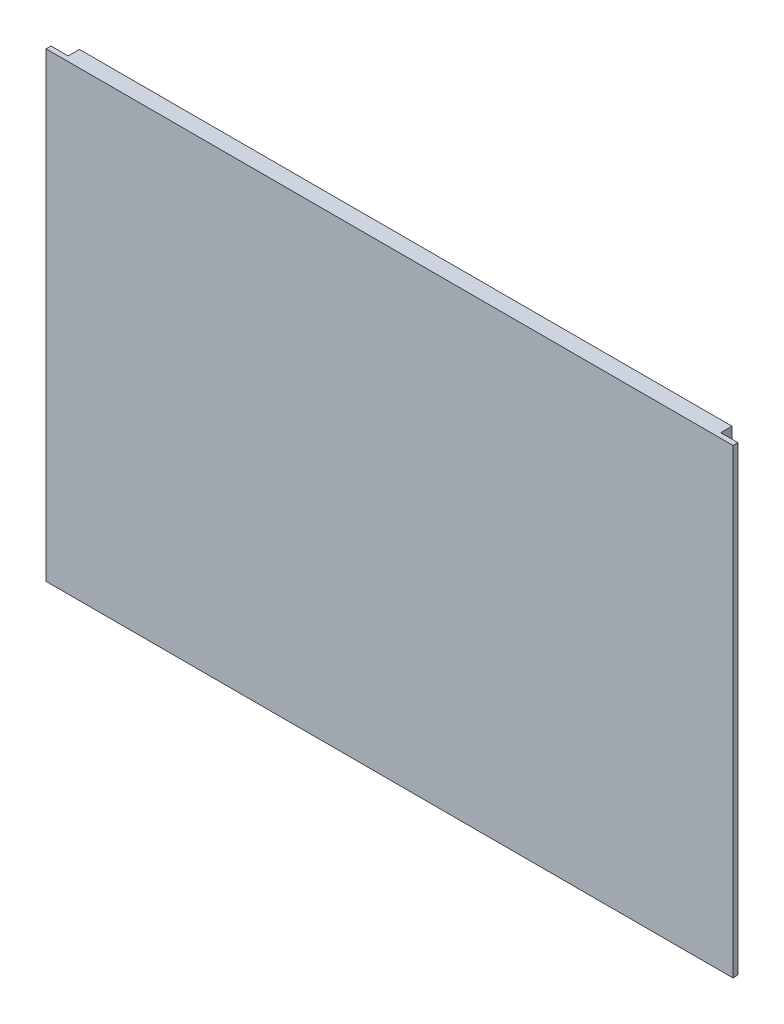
ISO-10303-21;
HEADER;
FILE_DESCRIPTION(('STEP AP214'),'2;1');
FILE_NAME('part.step','',(''),(''),'','','');
FILE_SCHEMA(('AUTOMOTIVE_DESIGN { 1 0 10303 214 1 1 1 1 }'));
ENDSEC;
DATA;
#1=APPLICATION_CONTEXT('core data for automotive mechanical design processes');
#2=APPLICATION_PROTOCOL_DEFINITION('international standard','automotive_design',2000,#1);
#3=PRODUCT_CONTEXT('',#1,'mechanical');
#4=PRODUCT('Part','Part','',(#3));
#5=PRODUCT_RELATED_PRODUCT_CATEGORY('part','',(#4));
#6=PRODUCT_DEFINITION_FORMATION('','',#4);
#7=PRODUCT_DEFINITION_CONTEXT('part definition',#1,'design');
#8=PRODUCT_DEFINITION('design','',#6,#7);
#9=PRODUCT_DEFINITION_SHAPE('','',#8);
#10=(LENGTH_UNIT() NAMED_UNIT(*) SI_UNIT(.MILLI.,.METRE.));
#11=(NAMED_UNIT(*) PLANE_ANGLE_UNIT() SI_UNIT($,.RADIAN.));
#12=(NAMED_UNIT(*) SI_UNIT($,.STERADIAN.) SOLID_ANGLE_UNIT());
#13=UNCERTAINTY_MEASURE_WITH_UNIT(LENGTH_MEASURE(1.E-05),#10,'distance_accuracy_value','');
#14=(GEOMETRIC_REPRESENTATION_CONTEXT(3) GLOBAL_UNCERTAINTY_ASSIGNED_CONTEXT((#13)) GLOBAL_UNIT_ASSIGNED_CONTEXT((#10,
#11,#12)) REPRESENTATION_CONTEXT('',''));
#15=CARTESIAN_POINT('',(0.,0.,0.));
#16=DIRECTION('',(0.,0.,1.));
#17=DIRECTION('',(1.,0.,0.));
#18=AXIS2_PLACEMENT_3D('',#15,#16,#17);
#19=CARTESIAN_POINT('',(-78.695652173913,40.8695652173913,-1.));
#20=DIRECTION('',(-1.,0.,0.));
#21=DIRECTION('',(0.,-1.,0.));
#22=AXIS2_PLACEMENT_3D('',#19,#20,#21);
#23=PLANE('',#22);
#24=DIRECTION('',(0.,-1.,0.));
#25=VECTOR('',#24,1.);
#26=CARTESIAN_POINT('',(-78.695652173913,40.8695652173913,-1.));
#27=LINE('',#26,#25);
#28=CARTESIAN_POINT('',(-78.695652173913,40.8695652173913,-1.));
#29=VERTEX_POINT('',#28);
#30=CARTESIAN_POINT('',(-78.695652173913,-53.0304347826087,-1.));
#31=VERTEX_POINT('',#30);
#32=EDGE_CURVE('E519',#29,#31,#27,.T.);
#33=ORIENTED_EDGE('',*,*,#32,.T.);
#34=DIRECTION('',(0.,0.166571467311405,-0.986029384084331));
#35=VECTOR('',#34,1.);
#36=CARTESIAN_POINT('',(-78.695652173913,-53.0304347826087,-1.));
#37=LINE('',#36,#35);
#38=CARTESIAN_POINT('',(-78.695652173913,-53.1304347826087,-0.408044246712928));
#39=VERTEX_POINT('',#38);
#40=EDGE_CURVE('E522',#39,#31,#37,.T.);
#41=ORIENTED_EDGE('',*,*,#40,.F.);
#42=DIRECTION('',(0.,0.,1.));
#43=VECTOR('',#42,1.);
#44=CARTESIAN_POINT('',(-78.695652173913,-53.1304347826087,-1.));
#45=LINE('',#44,#43);
#46=CARTESIAN_POINT('',(-78.695652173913,-53.1304347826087,0.));
#47=VERTEX_POINT('',#46);
#48=EDGE_CURVE('E529',#39,#47,#45,.T.);
#49=ORIENTED_EDGE('',*,*,#48,.T.);
#50=DIRECTION('',(0.,-1.,0.));
#51=VECTOR('',#50,1.);
#52=CARTESIAN_POINT('',(-78.695652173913,40.8695652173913,0.));
#53=LINE('',#52,#51);
#54=CARTESIAN_POINT('',(-78.695652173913,40.8695652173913,0.));
#55=VERTEX_POINT('',#54);
#56=EDGE_CURVE('E683',#55,#47,#53,.T.);
#57=ORIENTED_EDGE('',*,*,#56,.F.);
#58=DIRECTION('',(0.,0.,1.));
#59=VECTOR('',#58,1.);
#60=CARTESIAN_POINT('',(-78.695652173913,40.8695652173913,-1.));
#61=LINE('',#60,#59);
#62=EDGE_CURVE('E525',#29,#55,#61,.T.);
#63=ORIENTED_EDGE('',*,*,#62,.F.);
#64=EDGE_LOOP('',(#33,#41,#49,#57,#63));
#65=FACE_BOUND('',#64,.T.);
#66=ADVANCED_FACE('F51',(#65),#23,.T.);
#67=CARTESIAN_POINT('',(61.304347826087,40.8695652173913,-1.));
#68=DIRECTION('',(1.,0.,0.));
#69=DIRECTION('',(0.,1.,0.));
#70=AXIS2_PLACEMENT_3D('',#67,#68,#69);
#71=PLANE('',#70);
#72=DIRECTION('',(0.,1.,0.));
#73=VECTOR('',#72,1.);
#74=CARTESIAN_POINT('',(61.304347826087,40.8695652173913,-1.));
#75=LINE('',#74,#73);
#76=CARTESIAN_POINT('',(61.304347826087,-53.0304347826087,-1.));
#77=VERTEX_POINT('',#76);
#78=CARTESIAN_POINT('',(61.304347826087,40.8695652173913,-1.));
#79=VERTEX_POINT('',#78);
#80=EDGE_CURVE('E563',#77,#79,#75,.T.);
#81=ORIENTED_EDGE('',*,*,#80,.T.);
#82=DIRECTION('',(0.,0.,1.));
#83=VECTOR('',#82,1.);
#84=CARTESIAN_POINT('',(61.304347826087,40.8695652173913,-1.));
#85=LINE('',#84,#83);
#86=CARTESIAN_POINT('',(61.304347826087,40.8695652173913,0.));
#87=VERTEX_POINT('',#86);
#88=EDGE_CURVE('E560',#79,#87,#85,.T.);
#89=ORIENTED_EDGE('',*,*,#88,.T.);
#90=DIRECTION('',(0.,1.,0.));
#91=VECTOR('',#90,1.);
#92=CARTESIAN_POINT('',(61.304347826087,40.8695652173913,0.));
#93=LINE('',#92,#91);
#94=CARTESIAN_POINT('',(61.304347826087,-53.1304347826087,0.));
#95=VERTEX_POINT('',#94);
#96=EDGE_CURVE('E684',#95,#87,#93,.T.);
#97=ORIENTED_EDGE('',*,*,#96,.F.);
#98=DIRECTION('',(0.,0.,1.));
#99=VECTOR('',#98,1.);
#100=CARTESIAN_POINT('',(61.304347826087,-53.1304347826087,-1.));
#101=LINE('',#100,#99);
#102=CARTESIAN_POINT('',(61.304347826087,-53.1304347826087,-0.408044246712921));
#103=VERTEX_POINT('',#102);
#104=EDGE_CURVE('E557',#103,#95,#101,.T.);
#105=ORIENTED_EDGE('',*,*,#104,.F.);
#106=DIRECTION('',(0.,0.166571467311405,-0.986029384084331));
#107=VECTOR('',#106,1.);
#108=CARTESIAN_POINT('',(61.304347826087,-53.0304347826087,-1.));
#109=LINE('',#108,#107);
#110=EDGE_CURVE('E528',#103,#77,#109,.T.);
#111=ORIENTED_EDGE('',*,*,#110,.T.);
#112=EDGE_LOOP('',(#81,#89,#97,#105,#111));
#113=FACE_BOUND('',#112,.T.);
#114=ADVANCED_FACE('F647',(#113),#71,.T.);
#115=CARTESIAN_POINT('',(-78.695652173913,-53.1304347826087,-1.));
#116=DIRECTION('',(0.,-1.,0.));
#117=DIRECTION('',(0.,0.,-1.));
#118=AXIS2_PLACEMENT_3D('',#115,#116,#117);
#119=PLANE('',#118);
#120=DIRECTION('',(-1.,0.,0.));
#121=VECTOR('',#120,1.);
#122=CARTESIAN_POINT('',(-78.695652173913,-53.1304347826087,-0.408044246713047));
#123=LINE('',#122,#121);
#124=EDGE_CURVE('E548',#103,#39,#123,.T.);
#125=ORIENTED_EDGE('',*,*,#124,.F.);
#126=ORIENTED_EDGE('',*,*,#104,.T.);
#127=DIRECTION('',(1.,0.,0.));
#128=VECTOR('',#127,1.);
#129=CARTESIAN_POINT('',(-78.695652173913,-53.1304347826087,0.));
#130=LINE('',#129,#128);
#131=EDGE_CURVE('E686',#47,#95,#130,.T.);
#132=ORIENTED_EDGE('',*,*,#131,.F.);
#133=ORIENTED_EDGE('',*,*,#48,.F.);
#134=EDGE_LOOP('',(#125,#126,#132,#133));
#135=FACE_BOUND('',#134,.T.);
#136=ADVANCED_FACE('F644',(#135),#119,.T.);
#137=CARTESIAN_POINT('',(0.,0.,-1.));
#138=DIRECTION('',(0.,0.,1.));
#139=DIRECTION('',(1.,0.,0.));
#140=AXIS2_PLACEMENT_3D('',#137,#138,#139);
#141=PLANE('',#140);
#142=DIRECTION('',(0.,1.,0.));
#143=VECTOR('',#142,1.);
#144=CARTESIAN_POINT('',(57.804347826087,-53.1304347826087,-1.));
#145=LINE('',#144,#143);
#146=CARTESIAN_POINT('',(57.804347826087,30.9695652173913,-0.999999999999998));
#147=VERTEX_POINT('',#146);
#148=CARTESIAN_POINT('',(57.804347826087,34.4695652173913,-1.));
#149=VERTEX_POINT('',#148);
#150=EDGE_CURVE('E1376',#147,#149,#145,.T.);
#151=ORIENTED_EDGE('',*,*,#150,.T.);
#152=DIRECTION('',(-1.,0.,0.));
#153=VECTOR('',#152,1.);
#154=CARTESIAN_POINT('',(65.4924261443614,34.4695652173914,-1.));
#155=LINE('',#154,#153);
#156=CARTESIAN_POINT('',(-75.195652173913,34.4695652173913,-1.));
#157=VERTEX_POINT('',#156);
#158=EDGE_CURVE('E559',#149,#157,#155,.T.);
#159=ORIENTED_EDGE('',*,*,#158,.T.);
#160=DIRECTION('',(0.,-1.,0.));
#161=VECTOR('',#160,1.);
#162=CARTESIAN_POINT('',(-75.195652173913,-53.1304347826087,-1.));
#163=LINE('',#162,#161);
#164=CARTESIAN_POINT('',(-75.195652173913,30.9695652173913,-0.999999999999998));
#165=VERTEX_POINT('',#164);
#166=EDGE_CURVE('E896',#157,#165,#163,.T.);
#167=ORIENTED_EDGE('',*,*,#166,.T.);
#168=DIRECTION('',(-1.,0.,0.));
#169=VECTOR('',#168,1.);
#170=CARTESIAN_POINT('',(65.4924261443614,30.9695652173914,-1.));
#171=LINE('',#170,#169);
#172=EDGE_CURVE('E861',#147,#165,#171,.T.);
#173=ORIENTED_EDGE('',*,*,#172,.F.);
#174=EDGE_LOOP('',(#151,#159,#167,#173));
#175=FACE_BOUND('',#174,.T.);
#176=DIRECTION('',(-1.,0.,0.));
#177=VECTOR('',#176,1.);
#178=CARTESIAN_POINT('',(65.4924261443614,36.9695652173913,-1.));
#179=LINE('',#178,#177);
#180=CARTESIAN_POINT('',(57.804347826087,36.9695652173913,-1.));
#181=VERTEX_POINT('',#180);
#182=CARTESIAN_POINT('',(-75.195652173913,36.9695652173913,-0.999999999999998));
#183=VERTEX_POINT('',#182);
#184=EDGE_CURVE('E553',#181,#183,#179,.T.);
#185=ORIENTED_EDGE('',*,*,#184,.F.);
#186=CARTESIAN_POINT('',(57.804347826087,40.8695652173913,-1.));
#187=VERTEX_POINT('',#186);
#188=EDGE_CURVE('E664',#181,#187,#145,.T.);
#189=ORIENTED_EDGE('',*,*,#188,.T.);
#190=DIRECTION('',(1.,0.,0.));
#191=VECTOR('',#190,1.);
#192=CARTESIAN_POINT('',(-78.695652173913,40.8695652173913,-1.));
#193=LINE('',#192,#191);
#194=EDGE_CURVE('E663',#187,#79,#193,.T.);
#195=ORIENTED_EDGE('',*,*,#194,.T.);
#196=ORIENTED_EDGE('',*,*,#80,.F.);
#197=DIRECTION('',(-1.,0.,0.));
#198=VECTOR('',#197,1.);
#199=CARTESIAN_POINT('',(65.4924261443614,-53.0304347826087,-1.));
#200=LINE('',#199,#198);
#201=CARTESIAN_POINT('',(57.804347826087,-53.0304347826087,-1.));
#202=VERTEX_POINT('',#201);
#203=EDGE_CURVE('E545',#77,#202,#200,.T.);
#204=ORIENTED_EDGE('',*,*,#203,.T.);
#205=CARTESIAN_POINT('',(57.804347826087,-49.5304347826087,-1.));
#206=VERTEX_POINT('',#205);
#207=EDGE_CURVE('E1316',#202,#206,#145,.T.);
#208=ORIENTED_EDGE('',*,*,#207,.T.);
#209=DIRECTION('',(-1.,0.,0.));
#210=VECTOR('',#209,1.);
#211=CARTESIAN_POINT('',(65.4924261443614,-49.5304347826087,-1.));
#212=LINE('',#211,#210);
#213=CARTESIAN_POINT('',(-75.195652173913,-49.5304347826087,-1.));
#214=VERTEX_POINT('',#213);
#215=EDGE_CURVE('E680',#206,#214,#212,.T.);
#216=ORIENTED_EDGE('',*,*,#215,.T.);
#217=CARTESIAN_POINT('',(-75.195652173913,-53.0304347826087,-1.));
#218=VERTEX_POINT('',#217);
#219=EDGE_CURVE('E537',#214,#218,#163,.T.);
#220=ORIENTED_EDGE('',*,*,#219,.T.);
#221=EDGE_CURVE('E532',#218,#31,#200,.T.);
#222=ORIENTED_EDGE('',*,*,#221,.T.);
#223=ORIENTED_EDGE('',*,*,#32,.F.);
#224=DIRECTION('',(1.,0.,0.));
#225=VECTOR('',#224,1.);
#226=CARTESIAN_POINT('',(-78.695652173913,40.8695652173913,-1.));
#227=LINE('',#226,#225);
#228=CARTESIAN_POINT('',(-75.195652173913,40.8695652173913,-1.));
#229=VERTEX_POINT('',#228);
#230=EDGE_CURVE('E668',#29,#229,#227,.T.);
#231=ORIENTED_EDGE('',*,*,#230,.T.);
#232=EDGE_CURVE('E890',#229,#183,#163,.T.);
#233=ORIENTED_EDGE('',*,*,#232,.T.);
#234=EDGE_LOOP('',(#185,#189,#195,#196,#204,#208,#216,#220,#222,#223,#231,#233));
#235=FACE_BOUND('',#234,.T.);
#236=CARTESIAN_POINT('',(57.804347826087,24.9695652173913,-1.));
#237=VERTEX_POINT('',#236);
#238=CARTESIAN_POINT('',(57.804347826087,28.4695652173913,-1.00000000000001));
#239=VERTEX_POINT('',#238);
#240=EDGE_CURVE('E1377',#237,#239,#145,.T.);
#241=ORIENTED_EDGE('',*,*,#240,.T.);
#242=DIRECTION('',(-1.,0.,0.));
#243=VECTOR('',#242,1.);
#244=CARTESIAN_POINT('',(65.4924261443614,28.4695652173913,-1.));
#245=LINE('',#244,#243);
#246=CARTESIAN_POINT('',(-75.195652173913,28.4695652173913,-1.00000000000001));
#247=VERTEX_POINT('',#246);
#248=EDGE_CURVE('E832',#239,#247,#245,.T.);
#249=ORIENTED_EDGE('',*,*,#248,.T.);
#250=CARTESIAN_POINT('',(-75.195652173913,24.9695652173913,-0.999999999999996));
#251=VERTEX_POINT('',#250);
#252=EDGE_CURVE('E899',#247,#251,#163,.T.);
#253=ORIENTED_EDGE('',*,*,#252,.T.);
#254=DIRECTION('',(-1.,0.,0.));
#255=VECTOR('',#254,1.);
#256=CARTESIAN_POINT('',(65.4924261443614,24.9695652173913,-1.));
#257=LINE('',#256,#255);
#258=EDGE_CURVE('E849',#237,#251,#257,.T.);
#259=ORIENTED_EDGE('',*,*,#258,.F.);
#260=EDGE_LOOP('',(#241,#249,#253,#259));
#261=FACE_BOUND('',#260,.T.);
#262=CARTESIAN_POINT('',(57.804347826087,18.9695652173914,-1.));
#263=VERTEX_POINT('',#262);
#264=CARTESIAN_POINT('',(57.804347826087,22.4695652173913,-1.));
#265=VERTEX_POINT('',#264);
#266=EDGE_CURVE('E1378',#263,#265,#145,.T.);
#267=ORIENTED_EDGE('',*,*,#266,.T.);
#268=DIRECTION('',(-1.,0.,0.));
#269=VECTOR('',#268,1.);
#270=CARTESIAN_POINT('',(65.4924261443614,22.4695652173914,-1.));
#271=LINE('',#270,#269);
#272=CARTESIAN_POINT('',(-75.195652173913,22.4695652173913,-1.));
#273=VERTEX_POINT('',#272);
#274=EDGE_CURVE('E820',#265,#273,#271,.T.);
#275=ORIENTED_EDGE('',*,*,#274,.T.);
#276=CARTESIAN_POINT('',(-75.195652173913,18.9695652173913,-0.999999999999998));
#277=VERTEX_POINT('',#276);
#278=EDGE_CURVE('E943',#273,#277,#163,.T.);
#279=ORIENTED_EDGE('',*,*,#278,.T.);
#280=DIRECTION('',(-1.,0.,0.));
#281=VECTOR('',#280,1.);
#282=CARTESIAN_POINT('',(65.4924261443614,18.9695652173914,-1.));
#283=LINE('',#282,#281);
#284=EDGE_CURVE('E838',#263,#277,#283,.T.);
#285=ORIENTED_EDGE('',*,*,#284,.F.);
#286=EDGE_LOOP('',(#267,#275,#279,#285));
#287=FACE_BOUND('',#286,.T.);
#288=CARTESIAN_POINT('',(57.804347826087,12.9695652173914,-1.));
#289=VERTEX_POINT('',#288);
#290=CARTESIAN_POINT('',(57.804347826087,16.4695652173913,-1.));
#291=VERTEX_POINT('',#290);
#292=EDGE_CURVE('E1410',#289,#291,#145,.T.);
#293=ORIENTED_EDGE('',*,*,#292,.T.);
#294=DIRECTION('',(-1.,0.,0.));
#295=VECTOR('',#294,1.);
#296=CARTESIAN_POINT('',(65.4924261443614,16.4695652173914,-1.));
#297=LINE('',#296,#295);
#298=CARTESIAN_POINT('',(-75.195652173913,16.4695652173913,-1.));
#299=VERTEX_POINT('',#298);
#300=EDGE_CURVE('E808',#291,#299,#297,.T.);
#301=ORIENTED_EDGE('',*,*,#300,.T.);
#302=CARTESIAN_POINT('',(-75.195652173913,12.9695652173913,-0.999999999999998));
#303=VERTEX_POINT('',#302);
#304=EDGE_CURVE('E939',#299,#303,#163,.T.);
#305=ORIENTED_EDGE('',*,*,#304,.T.);
#306=DIRECTION('',(-1.,0.,0.));
#307=VECTOR('',#306,1.);
#308=CARTESIAN_POINT('',(65.4924261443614,12.9695652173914,-1.));
#309=LINE('',#308,#307);
#310=EDGE_CURVE('E826',#289,#303,#309,.T.);
#311=ORIENTED_EDGE('',*,*,#310,.F.);
#312=EDGE_LOOP('',(#293,#301,#305,#311));
#313=FACE_BOUND('',#312,.T.);
#314=CARTESIAN_POINT('',(57.804347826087,6.96956521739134,-1.));
#315=VERTEX_POINT('',#314);
#316=CARTESIAN_POINT('',(57.804347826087,10.4695652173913,-1.));
#317=VERTEX_POINT('',#316);
#318=EDGE_CURVE('E1407',#315,#317,#145,.T.);
#319=ORIENTED_EDGE('',*,*,#318,.T.);
#320=DIRECTION('',(-1.,0.,0.));
#321=VECTOR('',#320,1.);
#322=CARTESIAN_POINT('',(65.4924261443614,10.4695652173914,-1.));
#323=LINE('',#322,#321);
#324=CARTESIAN_POINT('',(-75.195652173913,10.4695652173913,-1.));
#325=VERTEX_POINT('',#324);
#326=EDGE_CURVE('E796',#317,#325,#323,.T.);
#327=ORIENTED_EDGE('',*,*,#326,.T.);
#328=CARTESIAN_POINT('',(-75.195652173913,6.96956521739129,-0.999999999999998));
#329=VERTEX_POINT('',#328);
#330=EDGE_CURVE('E935',#325,#329,#163,.T.);
#331=ORIENTED_EDGE('',*,*,#330,.T.);
#332=DIRECTION('',(-1.,0.,0.));
#333=VECTOR('',#332,1.);
#334=CARTESIAN_POINT('',(65.4924261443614,6.96956521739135,-1.));
#335=LINE('',#334,#333);
#336=EDGE_CURVE('E814',#315,#329,#335,.T.);
#337=ORIENTED_EDGE('',*,*,#336,.F.);
#338=EDGE_LOOP('',(#319,#327,#331,#337));
#339=FACE_BOUND('',#338,.T.);
#340=CARTESIAN_POINT('',(57.804347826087,0.969565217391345,-1.));
#341=VERTEX_POINT('',#340);
#342=CARTESIAN_POINT('',(57.804347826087,4.46956521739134,-1.));
#343=VERTEX_POINT('',#342);
#344=EDGE_CURVE('E1404',#341,#343,#145,.T.);
#345=ORIENTED_EDGE('',*,*,#344,.T.);
#346=DIRECTION('',(-1.,0.,0.));
#347=VECTOR('',#346,1.);
#348=CARTESIAN_POINT('',(65.4924261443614,4.46956521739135,-1.));
#349=LINE('',#348,#347);
#350=CARTESIAN_POINT('',(-75.195652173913,4.4695652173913,-1.));
#351=VERTEX_POINT('',#350);
#352=EDGE_CURVE('E784',#343,#351,#349,.T.);
#353=ORIENTED_EDGE('',*,*,#352,.T.);
#354=CARTESIAN_POINT('',(-75.195652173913,0.969565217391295,-0.999999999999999));
#355=VERTEX_POINT('',#354);
#356=EDGE_CURVE('E931',#351,#355,#163,.T.);
#357=ORIENTED_EDGE('',*,*,#356,.T.);
#358=DIRECTION('',(-1.,0.,0.));
#359=VECTOR('',#358,1.);
#360=CARTESIAN_POINT('',(65.4924261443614,0.969565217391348,-1.));
#361=LINE('',#360,#359);
#362=EDGE_CURVE('E802',#341,#355,#361,.T.);
#363=ORIENTED_EDGE('',*,*,#362,.F.);
#364=EDGE_LOOP('',(#345,#353,#357,#363));
#365=FACE_BOUND('',#364,.T.);
#366=CARTESIAN_POINT('',(57.804347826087,-5.03043478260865,-1.));
#367=VERTEX_POINT('',#366);
#368=CARTESIAN_POINT('',(57.804347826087,-1.53043478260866,-1.));
#369=VERTEX_POINT('',#368);
#370=EDGE_CURVE('E1401',#367,#369,#145,.T.);
#371=ORIENTED_EDGE('',*,*,#370,.T.);
#372=DIRECTION('',(-1.,0.,0.));
#373=VECTOR('',#372,1.);
#374=CARTESIAN_POINT('',(65.4924261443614,-1.53043478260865,-1.));
#375=LINE('',#374,#373);
#376=CARTESIAN_POINT('',(-75.195652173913,-1.5304347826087,-1.));
#377=VERTEX_POINT('',#376);
#378=EDGE_CURVE('E772',#369,#377,#375,.T.);
#379=ORIENTED_EDGE('',*,*,#378,.T.);
#380=CARTESIAN_POINT('',(-75.195652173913,-5.0304347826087,-0.999999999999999));
#381=VERTEX_POINT('',#380);
#382=EDGE_CURVE('E927',#377,#381,#163,.T.);
#383=ORIENTED_EDGE('',*,*,#382,.T.);
#384=DIRECTION('',(-1.,0.,0.));
#385=VECTOR('',#384,1.);
#386=CARTESIAN_POINT('',(65.4924261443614,-5.03043478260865,-1.));
#387=LINE('',#386,#385);
#388=EDGE_CURVE('E790',#367,#381,#387,.T.);
#389=ORIENTED_EDGE('',*,*,#388,.F.);
#390=EDGE_LOOP('',(#371,#379,#383,#389));
#391=FACE_BOUND('',#390,.T.);
#392=CARTESIAN_POINT('',(57.804347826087,-11.0304347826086,-1.));
#393=VERTEX_POINT('',#392);
#394=CARTESIAN_POINT('',(57.804347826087,-7.53043478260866,-1.));
#395=VERTEX_POINT('',#394);
#396=EDGE_CURVE('E1398',#393,#395,#145,.T.);
#397=ORIENTED_EDGE('',*,*,#396,.T.);
#398=DIRECTION('',(-1.,0.,0.));
#399=VECTOR('',#398,1.);
#400=CARTESIAN_POINT('',(65.4924261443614,-7.53043478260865,-1.));
#401=LINE('',#400,#399);
#402=CARTESIAN_POINT('',(-75.195652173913,-7.5304347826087,-1.));
#403=VERTEX_POINT('',#402);
#404=EDGE_CURVE('E760',#395,#403,#401,.T.);
#405=ORIENTED_EDGE('',*,*,#404,.T.);
#406=CARTESIAN_POINT('',(-75.195652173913,-11.0304347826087,-1.));
#407=VERTEX_POINT('',#406);
#408=EDGE_CURVE('E923',#403,#407,#163,.T.);
#409=ORIENTED_EDGE('',*,*,#408,.T.);
#410=DIRECTION('',(-1.,0.,0.));
#411=VECTOR('',#410,1.);
#412=CARTESIAN_POINT('',(65.4924261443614,-11.0304347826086,-1.));
#413=LINE('',#412,#411);
#414=EDGE_CURVE('E778',#393,#407,#413,.T.);
#415=ORIENTED_EDGE('',*,*,#414,.F.);
#416=EDGE_LOOP('',(#397,#405,#409,#415));
#417=FACE_BOUND('',#416,.T.);
#418=CARTESIAN_POINT('',(57.804347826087,-17.0304347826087,-1.));
#419=VERTEX_POINT('',#418);
#420=CARTESIAN_POINT('',(57.804347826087,-13.5304347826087,-1.));
#421=VERTEX_POINT('',#420);
#422=EDGE_CURVE('E1395',#419,#421,#145,.T.);
#423=ORIENTED_EDGE('',*,*,#422,.T.);
#424=DIRECTION('',(-1.,0.,0.));
#425=VECTOR('',#424,1.);
#426=CARTESIAN_POINT('',(65.4924261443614,-13.5304347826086,-1.));
#427=LINE('',#426,#425);
#428=CARTESIAN_POINT('',(-75.195652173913,-13.5304347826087,-1.));
#429=VERTEX_POINT('',#428);
#430=EDGE_CURVE('E748',#421,#429,#427,.T.);
#431=ORIENTED_EDGE('',*,*,#430,.T.);
#432=CARTESIAN_POINT('',(-75.195652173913,-17.0304347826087,-0.999999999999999));
#433=VERTEX_POINT('',#432);
#434=EDGE_CURVE('E919',#429,#433,#163,.T.);
#435=ORIENTED_EDGE('',*,*,#434,.T.);
#436=DIRECTION('',(-1.,0.,0.));
#437=VECTOR('',#436,1.);
#438=CARTESIAN_POINT('',(65.4924261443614,-17.0304347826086,-1.));
#439=LINE('',#438,#437);
#440=EDGE_CURVE('E766',#419,#433,#439,.T.);
#441=ORIENTED_EDGE('',*,*,#440,.F.);
#442=EDGE_LOOP('',(#423,#431,#435,#441));
#443=FACE_BOUND('',#442,.T.);
#444=CARTESIAN_POINT('',(57.804347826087,-23.0304347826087,-1.));
#445=VERTEX_POINT('',#444);
#446=CARTESIAN_POINT('',(57.804347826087,-19.5304347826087,-1.));
#447=VERTEX_POINT('',#446);
#448=EDGE_CURVE('E1392',#445,#447,#145,.T.);
#449=ORIENTED_EDGE('',*,*,#448,.T.);
#450=DIRECTION('',(-1.,0.,0.));
#451=VECTOR('',#450,1.);
#452=CARTESIAN_POINT('',(65.4924261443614,-19.5304347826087,-1.));
#453=LINE('',#452,#451);
#454=CARTESIAN_POINT('',(-75.195652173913,-19.5304347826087,-1.));
#455=VERTEX_POINT('',#454);
#456=EDGE_CURVE('E736',#447,#455,#453,.T.);
#457=ORIENTED_EDGE('',*,*,#456,.T.);
#458=CARTESIAN_POINT('',(-75.195652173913,-23.0304347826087,-1.));
#459=VERTEX_POINT('',#458);
#460=EDGE_CURVE('E915',#455,#459,#163,.T.);
#461=ORIENTED_EDGE('',*,*,#460,.T.);
#462=DIRECTION('',(-1.,0.,0.));
#463=VECTOR('',#462,1.);
#464=CARTESIAN_POINT('',(65.4924261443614,-23.0304347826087,-1.));
#465=LINE('',#464,#463);
#466=EDGE_CURVE('E754',#445,#459,#465,.T.);
#467=ORIENTED_EDGE('',*,*,#466,.F.);
#468=EDGE_LOOP('',(#449,#457,#461,#467));
#469=FACE_BOUND('',#468,.T.);
#470=CARTESIAN_POINT('',(57.804347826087,-29.0304347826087,-1.));
#471=VERTEX_POINT('',#470);
#472=CARTESIAN_POINT('',(57.804347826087,-25.5304347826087,-1.));
#473=VERTEX_POINT('',#472);
#474=EDGE_CURVE('E1389',#471,#473,#145,.T.);
#475=ORIENTED_EDGE('',*,*,#474,.T.);
#476=DIRECTION('',(-1.,0.,0.));
#477=VECTOR('',#476,1.);
#478=CARTESIAN_POINT('',(65.4924261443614,-25.5304347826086,-1.));
#479=LINE('',#478,#477);
#480=CARTESIAN_POINT('',(-75.195652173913,-25.5304347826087,-1.));
#481=VERTEX_POINT('',#480);
#482=EDGE_CURVE('E724',#473,#481,#479,.T.);
#483=ORIENTED_EDGE('',*,*,#482,.T.);
#484=CARTESIAN_POINT('',(-75.195652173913,-29.0304347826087,-1.));
#485=VERTEX_POINT('',#484);
#486=EDGE_CURVE('E911',#481,#485,#163,.T.);
#487=ORIENTED_EDGE('',*,*,#486,.T.);
#488=DIRECTION('',(-1.,0.,0.));
#489=VECTOR('',#488,1.);
#490=CARTESIAN_POINT('',(65.4924261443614,-29.0304347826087,-1.));
#491=LINE('',#490,#489);
#492=EDGE_CURVE('E742',#471,#485,#491,.T.);
#493=ORIENTED_EDGE('',*,*,#492,.F.);
#494=EDGE_LOOP('',(#475,#483,#487,#493));
#495=FACE_BOUND('',#494,.T.);
#496=CARTESIAN_POINT('',(57.804347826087,-35.0304347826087,-1.));
#497=VERTEX_POINT('',#496);
#498=CARTESIAN_POINT('',(57.804347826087,-31.5304347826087,-1.));
#499=VERTEX_POINT('',#498);
#500=EDGE_CURVE('E1386',#497,#499,#145,.T.);
#501=ORIENTED_EDGE('',*,*,#500,.T.);
#502=DIRECTION('',(-1.,0.,0.));
#503=VECTOR('',#502,1.);
#504=CARTESIAN_POINT('',(65.4924261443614,-31.5304347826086,-1.));
#505=LINE('',#504,#503);
#506=CARTESIAN_POINT('',(-75.195652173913,-31.5304347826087,-1.));
#507=VERTEX_POINT('',#506);
#508=EDGE_CURVE('E712',#499,#507,#505,.T.);
#509=ORIENTED_EDGE('',*,*,#508,.T.);
#510=CARTESIAN_POINT('',(-75.195652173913,-35.0304347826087,-1.));
#511=VERTEX_POINT('',#510);
#512=EDGE_CURVE('E907',#507,#511,#163,.T.);
#513=ORIENTED_EDGE('',*,*,#512,.T.);
#514=DIRECTION('',(-1.,0.,0.));
#515=VECTOR('',#514,1.);
#516=CARTESIAN_POINT('',(65.4924261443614,-35.0304347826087,-1.));
#517=LINE('',#516,#515);
#518=EDGE_CURVE('E730',#497,#511,#517,.T.);
#519=ORIENTED_EDGE('',*,*,#518,.F.);
#520=EDGE_LOOP('',(#501,#509,#513,#519));
#521=FACE_BOUND('',#520,.T.);
#522=CARTESIAN_POINT('',(57.804347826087,-41.0304347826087,-1.));
#523=VERTEX_POINT('',#522);
#524=CARTESIAN_POINT('',(57.804347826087,-37.5304347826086,-1.));
#525=VERTEX_POINT('',#524);
#526=EDGE_CURVE('E1383',#523,#525,#145,.T.);
#527=ORIENTED_EDGE('',*,*,#526,.T.);
#528=DIRECTION('',(-1.,0.,0.));
#529=VECTOR('',#528,1.);
#530=CARTESIAN_POINT('',(65.4924261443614,-37.5304347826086,-1.));
#531=LINE('',#530,#529);
#532=CARTESIAN_POINT('',(-75.195652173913,-37.5304347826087,-1.));
#533=VERTEX_POINT('',#532);
#534=EDGE_CURVE('E700',#525,#533,#531,.T.);
#535=ORIENTED_EDGE('',*,*,#534,.T.);
#536=CARTESIAN_POINT('',(-75.195652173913,-41.0304347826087,-1.));
#537=VERTEX_POINT('',#536);
#538=EDGE_CURVE('E903',#533,#537,#163,.T.);
#539=ORIENTED_EDGE('',*,*,#538,.T.);
#540=DIRECTION('',(-1.,0.,0.));
#541=VECTOR('',#540,1.);
#542=CARTESIAN_POINT('',(65.4924261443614,-41.0304347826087,-1.));
#543=LINE('',#542,#541);
#544=EDGE_CURVE('E718',#523,#537,#543,.T.);
#545=ORIENTED_EDGE('',*,*,#544,.F.);
#546=EDGE_LOOP('',(#527,#535,#539,#545));
#547=FACE_BOUND('',#546,.T.);
#548=CARTESIAN_POINT('',(57.804347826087,-47.0304347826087,-1.));
#549=VERTEX_POINT('',#548);
#550=CARTESIAN_POINT('',(57.804347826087,-43.5304347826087,-1.));
#551=VERTEX_POINT('',#550);
#552=EDGE_CURVE('E65',#549,#551,#145,.T.);
#553=ORIENTED_EDGE('',*,*,#552,.T.);
#554=DIRECTION('',(-1.,0.,0.));
#555=VECTOR('',#554,1.);
#556=CARTESIAN_POINT('',(65.4924261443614,-43.5304347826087,-1.));
#557=LINE('',#556,#555);
#558=CARTESIAN_POINT('',(-75.195652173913,-43.5304347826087,-1.));
#559=VERTEX_POINT('',#558);
#560=EDGE_CURVE('E697',#551,#559,#557,.T.);
#561=ORIENTED_EDGE('',*,*,#560,.T.);
#562=CARTESIAN_POINT('',(-75.195652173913,-47.0304347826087,-1.));
#563=VERTEX_POINT('',#562);
#564=EDGE_CURVE('E901',#559,#563,#163,.T.);
#565=ORIENTED_EDGE('',*,*,#564,.T.);
#566=DIRECTION('',(-1.,0.,0.));
#567=VECTOR('',#566,1.);
#568=CARTESIAN_POINT('',(65.4924261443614,-47.0304347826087,-1.));
#569=LINE('',#568,#567);
#570=EDGE_CURVE('E706',#549,#563,#569,.T.);
#571=ORIENTED_EDGE('',*,*,#570,.F.);
#572=EDGE_LOOP('',(#553,#561,#565,#571));
#573=FACE_BOUND('',#572,.T.);
#574=ADVANCED_FACE('F534',(#175,#235,#261,#287,#313,#339,#365,#391,#417,#443,#469,#495,#521,
#547,#573),#141,.F.);
#575=CARTESIAN_POINT('',(-78.695652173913,40.8695652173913,-1.));
#576=DIRECTION('',(0.,1.,0.));
#577=DIRECTION('',(0.,0.,1.));
#578=AXIS2_PLACEMENT_3D('',#575,#576,#577);
#579=PLANE('',#578);
#580=ORIENTED_EDGE('',*,*,#194,.F.);
#581=DIRECTION('',(0.,0.,1.));
#582=VECTOR('',#581,1.);
#583=CARTESIAN_POINT('',(57.804347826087,40.8695652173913,-1.));
#584=LINE('',#583,#582);
#585=CARTESIAN_POINT('',(57.804347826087,40.8695652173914,-3.3));
#586=VERTEX_POINT('',#585);
#587=EDGE_CURVE('E873',#586,#187,#584,.T.);
#588=ORIENTED_EDGE('',*,*,#587,.F.);
#589=DIRECTION('',(-1.,0.,0.));
#590=VECTOR('',#589,1.);
#591=CARTESIAN_POINT('',(64.7248741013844,40.8695652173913,-3.3));
#592=LINE('',#591,#590);
#593=CARTESIAN_POINT('',(-75.195652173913,40.8695652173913,-3.3));
#594=VERTEX_POINT('',#593);
#595=EDGE_CURVE('E681',#586,#594,#592,.T.);
#596=ORIENTED_EDGE('',*,*,#595,.T.);
#597=DIRECTION('',(0.,0.,-1.));
#598=VECTOR('',#597,1.);
#599=CARTESIAN_POINT('',(-75.195652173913,40.8695652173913,-1.));
#600=LINE('',#599,#598);
#601=EDGE_CURVE('E872',#229,#594,#600,.T.);
#602=ORIENTED_EDGE('',*,*,#601,.F.);
#603=ORIENTED_EDGE('',*,*,#230,.F.);
#604=ORIENTED_EDGE('',*,*,#62,.T.);
#605=DIRECTION('',(-1.,0.,0.));
#606=VECTOR('',#605,1.);
#607=CARTESIAN_POINT('',(-78.695652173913,40.8695652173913,0.));
#608=LINE('',#607,#606);
#609=EDGE_CURVE('E672',#87,#55,#608,.T.);
#610=ORIENTED_EDGE('',*,*,#609,.F.);
#611=ORIENTED_EDGE('',*,*,#88,.F.);
#612=EDGE_LOOP('',(#580,#588,#596,#602,#603,#604,#610,#611));
#613=FACE_BOUND('',#612,.T.);
#614=ADVANCED_FACE('F643',(#613),#579,.T.);
#615=CARTESIAN_POINT('',(0.,0.,0.));
#616=DIRECTION('',(0.,0.,1.));
#617=DIRECTION('',(1.,0.,0.));
#618=AXIS2_PLACEMENT_3D('',#615,#616,#617);
#619=PLANE('',#618);
#620=ORIENTED_EDGE('',*,*,#96,.T.);
#621=ORIENTED_EDGE('',*,*,#609,.T.);
#622=ORIENTED_EDGE('',*,*,#56,.T.);
#623=ORIENTED_EDGE('',*,*,#131,.T.);
#624=EDGE_LOOP('',(#620,#621,#622,#623));
#625=FACE_BOUND('',#624,.T.);
#626=ADVANCED_FACE('F1063',(#625),#619,.T.);
#627=CARTESIAN_POINT('',(65.4924261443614,-50.0304347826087,-3.3));
#628=DIRECTION('',(0.,0.977176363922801,-0.212429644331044));
#629=DIRECTION('',(0.,0.212429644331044,0.977176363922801));
#630=AXIS2_PLACEMENT_3D('',#627,#628,#629);
#631=PLANE('',#630);
#632=DIRECTION('',(0.,0.212429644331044,0.977176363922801));
#633=VECTOR('',#632,1.);
#634=CARTESIAN_POINT('',(57.804347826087,-50.0304347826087,-3.3));
#635=LINE('',#634,#633);
#636=CARTESIAN_POINT('',(57.804347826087,-50.0304347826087,-3.3));
#637=VERTEX_POINT('',#636);
#638=EDGE_CURVE('E1022',#637,#206,#635,.T.);
#639=ORIENTED_EDGE('',*,*,#638,.F.);
#640=DIRECTION('',(-1.,0.,0.));
#641=VECTOR('',#640,1.);
#642=CARTESIAN_POINT('',(65.4924261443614,-50.0304347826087,-3.3));
#643=LINE('',#642,#641);
#644=CARTESIAN_POINT('',(-75.195652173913,-50.0304347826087,-3.3));
#645=VERTEX_POINT('',#644);
#646=EDGE_CURVE('E689',#637,#645,#643,.T.);
#647=ORIENTED_EDGE('',*,*,#646,.T.);
#648=DIRECTION('',(0.,-0.212429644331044,-0.977176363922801));
#649=VECTOR('',#648,1.);
#650=CARTESIAN_POINT('',(-75.195652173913,-50.0304347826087,-3.29999999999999));
#651=LINE('',#650,#649);
#652=EDGE_CURVE('E1371',#214,#645,#651,.T.);
#653=ORIENTED_EDGE('',*,*,#652,.F.);
#654=ORIENTED_EDGE('',*,*,#215,.F.);
#655=EDGE_LOOP('',(#639,#647,#653,#654));
#656=FACE_BOUND('',#655,.T.);
#657=ADVANCED_FACE('F1066',(#656),#631,.T.);
#658=CARTESIAN_POINT('',(65.4924261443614,-52.5304347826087,-3.3));
#659=DIRECTION('',(0.,0.,-1.));
#660=DIRECTION('',(-1.,0.,0.));
#661=AXIS2_PLACEMENT_3D('',#658,#659,#660);
#662=PLANE('',#661);
#663=DIRECTION('',(0.,1.,0.));
#664=VECTOR('',#663,1.);
#665=CARTESIAN_POINT('',(57.804347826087,-53.1304347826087,-3.3));
#666=LINE('',#665,#664);
#667=CARTESIAN_POINT('',(57.804347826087,-52.5304347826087,-3.3));
#668=VERTEX_POINT('',#667);
#669=EDGE_CURVE('E886',#668,#637,#666,.T.);
#670=ORIENTED_EDGE('',*,*,#669,.F.);
#671=DIRECTION('',(-1.,0.,0.));
#672=VECTOR('',#671,1.);
#673=CARTESIAN_POINT('',(65.4924261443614,-52.5304347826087,-3.3));
#674=LINE('',#673,#672);
#675=CARTESIAN_POINT('',(-75.195652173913,-52.5304347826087,-3.3));
#676=VERTEX_POINT('',#675);
#677=EDGE_CURVE('E543',#668,#676,#674,.T.);
#678=ORIENTED_EDGE('',*,*,#677,.T.);
#679=DIRECTION('',(0.,-1.,0.));
#680=VECTOR('',#679,1.);
#681=CARTESIAN_POINT('',(-75.195652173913,-53.1304347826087,-3.3));
#682=LINE('',#681,#680);
#683=EDGE_CURVE('E883',#645,#676,#682,.T.);
#684=ORIENTED_EDGE('',*,*,#683,.F.);
#685=ORIENTED_EDGE('',*,*,#646,.F.);
#686=EDGE_LOOP('',(#670,#678,#684,#685));
#687=FACE_BOUND('',#686,.T.);
#688=ADVANCED_FACE('F1070',(#687),#662,.T.);
#689=CARTESIAN_POINT('',(65.4924261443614,-53.0304347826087,-1.));
#690=DIRECTION('',(0.,-0.977176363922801,-0.212429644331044));
#691=DIRECTION('',(0.,0.212429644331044,-0.977176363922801));
#692=AXIS2_PLACEMENT_3D('',#689,#690,#691);
#693=PLANE('',#692);
#694=DIRECTION('',(0.,0.212429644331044,-0.977176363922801));
#695=VECTOR('',#694,1.);
#696=CARTESIAN_POINT('',(57.804347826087,-53.0304347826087,-1.));
#697=LINE('',#696,#695);
#698=EDGE_CURVE('E1020',#202,#668,#697,.T.);
#699=ORIENTED_EDGE('',*,*,#698,.F.);
#700=EDGE_CURVE('E542',#202,#218,#200,.T.);
#701=ORIENTED_EDGE('',*,*,#700,.T.);
#702=DIRECTION('',(0.,-0.212429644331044,0.977176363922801));
#703=VECTOR('',#702,1.);
#704=CARTESIAN_POINT('',(-75.195652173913,-53.0304347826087,-1.00000000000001));
#705=LINE('',#704,#703);
#706=EDGE_CURVE('E1369',#676,#218,#705,.T.);
#707=ORIENTED_EDGE('',*,*,#706,.F.);
#708=ORIENTED_EDGE('',*,*,#677,.F.);
#709=EDGE_LOOP('',(#699,#701,#707,#708));
#710=FACE_BOUND('',#709,.T.);
#711=ADVANCED_FACE('F1074',(#710),#693,.T.);
#712=CARTESIAN_POINT('',(65.4924261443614,-44.0304347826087,-3.3));
#713=DIRECTION('',(0.,0.977176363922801,-0.212429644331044));
#714=DIRECTION('',(0.,0.212429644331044,0.977176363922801));
#715=AXIS2_PLACEMENT_3D('',#712,#713,#714);
#716=PLANE('',#715);
#717=DIRECTION('',(0.,0.212429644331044,0.977176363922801));
#718=VECTOR('',#717,1.);
#719=CARTESIAN_POINT('',(57.804347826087,-44.0304347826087,-3.3));
#720=LINE('',#719,#718);
#721=CARTESIAN_POINT('',(57.804347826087,-44.0304347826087,-3.3));
#722=VERTEX_POINT('',#721);
#723=EDGE_CURVE('E1018',#722,#551,#720,.T.);
#724=ORIENTED_EDGE('',*,*,#723,.F.);
#725=DIRECTION('',(-1.,0.,0.));
#726=VECTOR('',#725,1.);
#727=CARTESIAN_POINT('',(65.4924261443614,-44.0304347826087,-3.3));
#728=LINE('',#727,#726);
#729=CARTESIAN_POINT('',(-75.195652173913,-44.0304347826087,-3.3));
#730=VERTEX_POINT('',#729);
#731=EDGE_CURVE('E564',#722,#730,#728,.T.);
#732=ORIENTED_EDGE('',*,*,#731,.T.);
#733=DIRECTION('',(0.,-0.212429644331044,-0.977176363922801));
#734=VECTOR('',#733,1.);
#735=CARTESIAN_POINT('',(-75.195652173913,-44.0304347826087,-3.29999999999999));
#736=LINE('',#735,#734);
#737=EDGE_CURVE('E1367',#559,#730,#736,.T.);
#738=ORIENTED_EDGE('',*,*,#737,.F.);
#739=ORIENTED_EDGE('',*,*,#560,.F.);
#740=EDGE_LOOP('',(#724,#732,#738,#739));
#741=FACE_BOUND('',#740,.T.);
#742=ADVANCED_FACE('F1078',(#741),#716,.T.);
#743=CARTESIAN_POINT('',(65.4924261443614,-46.5304347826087,-3.3));
#744=DIRECTION('',(0.,0.,-1.));
#745=DIRECTION('',(-1.,0.,0.));
#746=AXIS2_PLACEMENT_3D('',#743,#744,#745);
#747=PLANE('',#746);
#748=CARTESIAN_POINT('',(57.804347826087,-46.5304347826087,-3.3));
#749=VERTEX_POINT('',#748);
#750=EDGE_CURVE('E1379',#749,#722,#666,.T.);
#751=ORIENTED_EDGE('',*,*,#750,.F.);
#752=DIRECTION('',(-1.,0.,0.));
#753=VECTOR('',#752,1.);
#754=CARTESIAN_POINT('',(65.4924261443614,-46.5304347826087,-3.3));
#755=LINE('',#754,#753);
#756=CARTESIAN_POINT('',(-75.195652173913,-46.5304347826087,-3.3));
#757=VERTEX_POINT('',#756);
#758=EDGE_CURVE('E703',#749,#757,#755,.T.);
#759=ORIENTED_EDGE('',*,*,#758,.T.);
#760=EDGE_CURVE('E73',#730,#757,#682,.T.);
#761=ORIENTED_EDGE('',*,*,#760,.F.);
#762=ORIENTED_EDGE('',*,*,#731,.F.);
#763=EDGE_LOOP('',(#751,#759,#761,#762));
#764=FACE_BOUND('',#763,.T.);
#765=ADVANCED_FACE('F1082',(#764),#747,.T.);
#766=CARTESIAN_POINT('',(65.4924261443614,-47.0304347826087,-1.));
#767=DIRECTION('',(0.,-0.977176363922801,-0.212429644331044));
#768=DIRECTION('',(0.,0.212429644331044,-0.977176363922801));
#769=AXIS2_PLACEMENT_3D('',#766,#767,#768);
#770=PLANE('',#769);
#771=DIRECTION('',(0.,0.212429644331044,-0.977176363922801));
#772=VECTOR('',#771,1.);
#773=CARTESIAN_POINT('',(57.804347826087,-47.0304347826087,-1.));
#774=LINE('',#773,#772);
#775=EDGE_CURVE('E1016',#549,#749,#774,.T.);
#776=ORIENTED_EDGE('',*,*,#775,.F.);
#777=ORIENTED_EDGE('',*,*,#570,.T.);
#778=DIRECTION('',(0.,-0.212429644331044,0.977176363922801));
#779=VECTOR('',#778,1.);
#780=CARTESIAN_POINT('',(-75.195652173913,-47.0304347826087,-1.00000000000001));
#781=LINE('',#780,#779);
#782=EDGE_CURVE('E1365',#757,#563,#781,.T.);
#783=ORIENTED_EDGE('',*,*,#782,.F.);
#784=ORIENTED_EDGE('',*,*,#758,.F.);
#785=EDGE_LOOP('',(#776,#777,#783,#784));
#786=FACE_BOUND('',#785,.T.);
#787=ADVANCED_FACE('F1086',(#786),#770,.T.);
#788=CARTESIAN_POINT('',(65.4924261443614,-38.0304347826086,-3.3));
#789=DIRECTION('',(0.,0.977176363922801,-0.212429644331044));
#790=DIRECTION('',(0.,0.212429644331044,0.977176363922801));
#791=AXIS2_PLACEMENT_3D('',#788,#789,#790);
#792=PLANE('',#791);
#793=DIRECTION('',(0.,0.212429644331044,0.977176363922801));
#794=VECTOR('',#793,1.);
#795=CARTESIAN_POINT('',(57.804347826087,-38.0304347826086,-3.3));
#796=LINE('',#795,#794);
#797=CARTESIAN_POINT('',(57.804347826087,-38.0304347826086,-3.3));
#798=VERTEX_POINT('',#797);
#799=EDGE_CURVE('E1014',#798,#525,#796,.T.);
#800=ORIENTED_EDGE('',*,*,#799,.F.);
#801=DIRECTION('',(-1.,0.,0.));
#802=VECTOR('',#801,1.);
#803=CARTESIAN_POINT('',(65.4924261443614,-38.0304347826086,-3.3));
#804=LINE('',#803,#802);
#805=CARTESIAN_POINT('',(-75.195652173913,-38.0304347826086,-3.3));
#806=VERTEX_POINT('',#805);
#807=EDGE_CURVE('E709',#798,#806,#804,.T.);
#808=ORIENTED_EDGE('',*,*,#807,.T.);
#809=DIRECTION('',(0.,-0.212429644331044,-0.977176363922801));
#810=VECTOR('',#809,1.);
#811=CARTESIAN_POINT('',(-75.195652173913,-38.0304347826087,-3.29999999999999));
#812=LINE('',#811,#810);
#813=EDGE_CURVE('E1363',#533,#806,#812,.T.);
#814=ORIENTED_EDGE('',*,*,#813,.F.);
#815=ORIENTED_EDGE('',*,*,#534,.F.);
#816=EDGE_LOOP('',(#800,#808,#814,#815));
#817=FACE_BOUND('',#816,.T.);
#818=ADVANCED_FACE('F1090',(#817),#792,.T.);
#819=CARTESIAN_POINT('',(65.4924261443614,-40.5304347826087,-3.3));
#820=DIRECTION('',(0.,0.,-1.));
#821=DIRECTION('',(-1.,0.,0.));
#822=AXIS2_PLACEMENT_3D('',#819,#820,#821);
#823=PLANE('',#822);
#824=CARTESIAN_POINT('',(57.804347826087,-40.5304347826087,-3.3));
#825=VERTEX_POINT('',#824);
#826=EDGE_CURVE('E1472',#825,#798,#666,.T.);
#827=ORIENTED_EDGE('',*,*,#826,.F.);
#828=DIRECTION('',(-1.,0.,0.));
#829=VECTOR('',#828,1.);
#830=CARTESIAN_POINT('',(65.4924261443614,-40.5304347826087,-3.3));
#831=LINE('',#830,#829);
#832=CARTESIAN_POINT('',(-75.195652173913,-40.5304347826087,-3.3));
#833=VERTEX_POINT('',#832);
#834=EDGE_CURVE('E715',#825,#833,#831,.T.);
#835=ORIENTED_EDGE('',*,*,#834,.T.);
#836=EDGE_CURVE('E894',#806,#833,#682,.T.);
#837=ORIENTED_EDGE('',*,*,#836,.F.);
#838=ORIENTED_EDGE('',*,*,#807,.F.);
#839=EDGE_LOOP('',(#827,#835,#837,#838));
#840=FACE_BOUND('',#839,.T.);
#841=ADVANCED_FACE('F1094',(#840),#823,.T.);
#842=CARTESIAN_POINT('',(65.4924261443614,-41.0304347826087,-1.));
#843=DIRECTION('',(0.,-0.977176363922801,-0.212429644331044));
#844=DIRECTION('',(0.,0.212429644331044,-0.977176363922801));
#845=AXIS2_PLACEMENT_3D('',#842,#843,#844);
#846=PLANE('',#845);
#847=DIRECTION('',(0.,0.212429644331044,-0.977176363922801));
#848=VECTOR('',#847,1.);
#849=CARTESIAN_POINT('',(57.804347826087,-41.0304347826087,-1.));
#850=LINE('',#849,#848);
#851=EDGE_CURVE('E1012',#523,#825,#850,.T.);
#852=ORIENTED_EDGE('',*,*,#851,.F.);
#853=ORIENTED_EDGE('',*,*,#544,.T.);
#854=DIRECTION('',(0.,-0.212429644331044,0.977176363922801));
#855=VECTOR('',#854,1.);
#856=CARTESIAN_POINT('',(-75.195652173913,-41.0304347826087,-1.00000000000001));
#857=LINE('',#856,#855);
#858=EDGE_CURVE('E1361',#833,#537,#857,.T.);
#859=ORIENTED_EDGE('',*,*,#858,.F.);
#860=ORIENTED_EDGE('',*,*,#834,.F.);
#861=EDGE_LOOP('',(#852,#853,#859,#860));
#862=FACE_BOUND('',#861,.T.);
#863=ADVANCED_FACE('F1098',(#862),#846,.T.);
#864=CARTESIAN_POINT('',(65.4924261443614,-32.0304347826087,-3.3));
#865=DIRECTION('',(0.,0.977176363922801,-0.212429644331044));
#866=DIRECTION('',(0.,0.212429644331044,0.977176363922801));
#867=AXIS2_PLACEMENT_3D('',#864,#865,#866);
#868=PLANE('',#867);
#869=DIRECTION('',(0.,0.212429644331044,0.977176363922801));
#870=VECTOR('',#869,1.);
#871=CARTESIAN_POINT('',(57.804347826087,-32.0304347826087,-3.3));
#872=LINE('',#871,#870);
#873=CARTESIAN_POINT('',(57.804347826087,-32.0304347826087,-3.3));
#874=VERTEX_POINT('',#873);
#875=EDGE_CURVE('E1010',#874,#499,#872,.T.);
#876=ORIENTED_EDGE('',*,*,#875,.F.);
#877=DIRECTION('',(-1.,0.,0.));
#878=VECTOR('',#877,1.);
#879=CARTESIAN_POINT('',(65.4924261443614,-32.0304347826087,-3.3));
#880=LINE('',#879,#878);
#881=CARTESIAN_POINT('',(-75.195652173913,-32.0304347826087,-3.3));
#882=VERTEX_POINT('',#881);
#883=EDGE_CURVE('E721',#874,#882,#880,.T.);
#884=ORIENTED_EDGE('',*,*,#883,.T.);
#885=DIRECTION('',(0.,-0.212429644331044,-0.977176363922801));
#886=VECTOR('',#885,1.);
#887=CARTESIAN_POINT('',(-75.195652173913,-32.0304347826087,-3.29999999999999));
#888=LINE('',#887,#886);
#889=EDGE_CURVE('E1359',#507,#882,#888,.T.);
#890=ORIENTED_EDGE('',*,*,#889,.F.);
#891=ORIENTED_EDGE('',*,*,#508,.F.);
#892=EDGE_LOOP('',(#876,#884,#890,#891));
#893=FACE_BOUND('',#892,.T.);
#894=ADVANCED_FACE('F1102',(#893),#868,.T.);
#895=CARTESIAN_POINT('',(65.4924261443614,-34.5304347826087,-3.3));
#896=DIRECTION('',(0.,0.,-1.));
#897=DIRECTION('',(-1.,0.,0.));
#898=AXIS2_PLACEMENT_3D('',#895,#896,#897);
#899=PLANE('',#898);
#900=CARTESIAN_POINT('',(57.804347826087,-34.5304347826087,-3.3));
#901=VERTEX_POINT('',#900);
#902=EDGE_CURVE('E1475',#901,#874,#666,.T.);
#903=ORIENTED_EDGE('',*,*,#902,.F.);
#904=DIRECTION('',(-1.,0.,0.));
#905=VECTOR('',#904,1.);
#906=CARTESIAN_POINT('',(65.4924261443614,-34.5304347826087,-3.3));
#907=LINE('',#906,#905);
#908=CARTESIAN_POINT('',(-75.195652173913,-34.5304347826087,-3.3));
#909=VERTEX_POINT('',#908);
#910=EDGE_CURVE('E727',#901,#909,#907,.T.);
#911=ORIENTED_EDGE('',*,*,#910,.T.);
#912=EDGE_CURVE('E1456',#882,#909,#682,.T.);
#913=ORIENTED_EDGE('',*,*,#912,.F.);
#914=ORIENTED_EDGE('',*,*,#883,.F.);
#915=EDGE_LOOP('',(#903,#911,#913,#914));
#916=FACE_BOUND('',#915,.T.);
#917=ADVANCED_FACE('F1106',(#916),#899,.T.);
#918=CARTESIAN_POINT('',(65.4924261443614,-35.0304347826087,-1.));
#919=DIRECTION('',(0.,-0.977176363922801,-0.212429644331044));
#920=DIRECTION('',(0.,0.212429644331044,-0.977176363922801));
#921=AXIS2_PLACEMENT_3D('',#918,#919,#920);
#922=PLANE('',#921);
#923=DIRECTION('',(0.,0.212429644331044,-0.977176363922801));
#924=VECTOR('',#923,1.);
#925=CARTESIAN_POINT('',(57.804347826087,-35.0304347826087,-1.));
#926=LINE('',#925,#924);
#927=EDGE_CURVE('E1008',#497,#901,#926,.T.);
#928=ORIENTED_EDGE('',*,*,#927,.F.);
#929=ORIENTED_EDGE('',*,*,#518,.T.);
#930=DIRECTION('',(0.,-0.212429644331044,0.977176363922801));
#931=VECTOR('',#930,1.);
#932=CARTESIAN_POINT('',(-75.195652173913,-35.0304347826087,-1.00000000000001));
#933=LINE('',#932,#931);
#934=EDGE_CURVE('E1357',#909,#511,#933,.T.);
#935=ORIENTED_EDGE('',*,*,#934,.F.);
#936=ORIENTED_EDGE('',*,*,#910,.F.);
#937=EDGE_LOOP('',(#928,#929,#935,#936));
#938=FACE_BOUND('',#937,.T.);
#939=ADVANCED_FACE('F1110',(#938),#922,.T.);
#940=CARTESIAN_POINT('',(65.4924261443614,-26.0304347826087,-3.3));
#941=DIRECTION('',(0.,0.977176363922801,-0.212429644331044));
#942=DIRECTION('',(0.,0.212429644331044,0.977176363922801));
#943=AXIS2_PLACEMENT_3D('',#940,#941,#942);
#944=PLANE('',#943);
#945=DIRECTION('',(0.,0.212429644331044,0.977176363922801));
#946=VECTOR('',#945,1.);
#947=CARTESIAN_POINT('',(57.804347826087,-26.0304347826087,-3.3));
#948=LINE('',#947,#946);
#949=CARTESIAN_POINT('',(57.804347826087,-26.0304347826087,-3.3));
#950=VERTEX_POINT('',#949);
#951=EDGE_CURVE('E1006',#950,#473,#948,.T.);
#952=ORIENTED_EDGE('',*,*,#951,.F.);
#953=DIRECTION('',(-1.,0.,0.));
#954=VECTOR('',#953,1.);
#955=CARTESIAN_POINT('',(65.4924261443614,-26.0304347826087,-3.3));
#956=LINE('',#955,#954);
#957=CARTESIAN_POINT('',(-75.195652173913,-26.0304347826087,-3.3));
#958=VERTEX_POINT('',#957);
#959=EDGE_CURVE('E733',#950,#958,#956,.T.);
#960=ORIENTED_EDGE('',*,*,#959,.T.);
#961=DIRECTION('',(0.,-0.212429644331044,-0.977176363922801));
#962=VECTOR('',#961,1.);
#963=CARTESIAN_POINT('',(-75.195652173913,-26.0304347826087,-3.29999999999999));
#964=LINE('',#963,#962);
#965=EDGE_CURVE('E1355',#481,#958,#964,.T.);
#966=ORIENTED_EDGE('',*,*,#965,.F.);
#967=ORIENTED_EDGE('',*,*,#482,.F.);
#968=EDGE_LOOP('',(#952,#960,#966,#967));
#969=FACE_BOUND('',#968,.T.);
#970=ADVANCED_FACE('F1114',(#969),#944,.T.);
#971=CARTESIAN_POINT('',(65.4924261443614,-28.5304347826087,-3.3));
#972=DIRECTION('',(0.,0.,-1.));
#973=DIRECTION('',(-1.,0.,0.));
#974=AXIS2_PLACEMENT_3D('',#971,#972,#973);
#975=PLANE('',#974);
#976=CARTESIAN_POINT('',(57.804347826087,-28.5304347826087,-3.3));
#977=VERTEX_POINT('',#976);
#978=EDGE_CURVE('E1476',#977,#950,#666,.T.);
#979=ORIENTED_EDGE('',*,*,#978,.F.);
#980=DIRECTION('',(-1.,0.,0.));
#981=VECTOR('',#980,1.);
#982=CARTESIAN_POINT('',(65.4924261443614,-28.5304347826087,-3.3));
#983=LINE('',#982,#981);
#984=CARTESIAN_POINT('',(-75.195652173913,-28.5304347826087,-3.3));
#985=VERTEX_POINT('',#984);
#986=EDGE_CURVE('E739',#977,#985,#983,.T.);
#987=ORIENTED_EDGE('',*,*,#986,.T.);
#988=EDGE_CURVE('E1452',#958,#985,#682,.T.);
#989=ORIENTED_EDGE('',*,*,#988,.F.);
#990=ORIENTED_EDGE('',*,*,#959,.F.);
#991=EDGE_LOOP('',(#979,#987,#989,#990));
#992=FACE_BOUND('',#991,.T.);
#993=ADVANCED_FACE('F1118',(#992),#975,.T.);
#994=CARTESIAN_POINT('',(65.4924261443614,-29.0304347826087,-1.));
#995=DIRECTION('',(0.,-0.977176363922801,-0.212429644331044));
#996=DIRECTION('',(0.,0.212429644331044,-0.977176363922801));
#997=AXIS2_PLACEMENT_3D('',#994,#995,#996);
#998=PLANE('',#997);
#999=DIRECTION('',(0.,0.212429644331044,-0.977176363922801));
#1000=VECTOR('',#999,1.);
#1001=CARTESIAN_POINT('',(57.804347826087,-29.0304347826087,-1.));
#1002=LINE('',#1001,#1000);
#1003=EDGE_CURVE('E1004',#471,#977,#1002,.T.);
#1004=ORIENTED_EDGE('',*,*,#1003,.F.);
#1005=ORIENTED_EDGE('',*,*,#492,.T.);
#1006=DIRECTION('',(0.,-0.212429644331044,0.977176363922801));
#1007=VECTOR('',#1006,1.);
#1008=CARTESIAN_POINT('',(-75.195652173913,-29.0304347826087,-1.00000000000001));
#1009=LINE('',#1008,#1007);
#1010=EDGE_CURVE('E1353',#985,#485,#1009,.T.);
#1011=ORIENTED_EDGE('',*,*,#1010,.F.);
#1012=ORIENTED_EDGE('',*,*,#986,.F.);
#1013=EDGE_LOOP('',(#1004,#1005,#1011,#1012));
#1014=FACE_BOUND('',#1013,.T.);
#1015=ADVANCED_FACE('F1122',(#1014),#998,.T.);
#1016=CARTESIAN_POINT('',(65.4924261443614,-20.0304347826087,-3.3));
#1017=DIRECTION('',(0.,0.977176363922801,-0.212429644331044));
#1018=DIRECTION('',(0.,0.212429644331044,0.977176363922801));
#1019=AXIS2_PLACEMENT_3D('',#1016,#1017,#1018);
#1020=PLANE('',#1019);
#1021=DIRECTION('',(0.,0.212429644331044,0.977176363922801));
#1022=VECTOR('',#1021,1.);
#1023=CARTESIAN_POINT('',(57.804347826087,-20.0304347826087,-3.3));
#1024=LINE('',#1023,#1022);
#1025=CARTESIAN_POINT('',(57.804347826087,-20.0304347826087,-3.3));
#1026=VERTEX_POINT('',#1025);
#1027=EDGE_CURVE('E1002',#1026,#447,#1024,.T.);
#1028=ORIENTED_EDGE('',*,*,#1027,.F.);
#1029=DIRECTION('',(-1.,0.,0.));
#1030=VECTOR('',#1029,1.);
#1031=CARTESIAN_POINT('',(65.4924261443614,-20.0304347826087,-3.3));
#1032=LINE('',#1031,#1030);
#1033=CARTESIAN_POINT('',(-75.195652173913,-20.0304347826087,-3.3));
#1034=VERTEX_POINT('',#1033);
#1035=EDGE_CURVE('E745',#1026,#1034,#1032,.T.);
#1036=ORIENTED_EDGE('',*,*,#1035,.T.);
#1037=DIRECTION('',(0.,-0.212429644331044,-0.977176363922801));
#1038=VECTOR('',#1037,1.);
#1039=CARTESIAN_POINT('',(-75.195652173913,-20.0304347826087,-3.29999999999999));
#1040=LINE('',#1039,#1038);
#1041=EDGE_CURVE('E1351',#455,#1034,#1040,.T.);
#1042=ORIENTED_EDGE('',*,*,#1041,.F.);
#1043=ORIENTED_EDGE('',*,*,#456,.F.);
#1044=EDGE_LOOP('',(#1028,#1036,#1042,#1043));
#1045=FACE_BOUND('',#1044,.T.);
#1046=ADVANCED_FACE('F1126',(#1045),#1020,.T.);
#1047=CARTESIAN_POINT('',(65.4924261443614,-22.5304347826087,-3.3));
#1048=DIRECTION('',(0.,0.,-1.));
#1049=DIRECTION('',(-1.,0.,0.));
#1050=AXIS2_PLACEMENT_3D('',#1047,#1048,#1049);
#1051=PLANE('',#1050);
#1052=CARTESIAN_POINT('',(57.804347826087,-22.5304347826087,-3.3));
#1053=VERTEX_POINT('',#1052);
#1054=EDGE_CURVE('E1480',#1053,#1026,#666,.T.);
#1055=ORIENTED_EDGE('',*,*,#1054,.F.);
#1056=DIRECTION('',(-1.,0.,0.));
#1057=VECTOR('',#1056,1.);
#1058=CARTESIAN_POINT('',(65.4924261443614,-22.5304347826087,-3.3));
#1059=LINE('',#1058,#1057);
#1060=CARTESIAN_POINT('',(-75.195652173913,-22.5304347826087,-3.3));
#1061=VERTEX_POINT('',#1060);
#1062=EDGE_CURVE('E751',#1053,#1061,#1059,.T.);
#1063=ORIENTED_EDGE('',*,*,#1062,.T.);
#1064=EDGE_CURVE('E1448',#1034,#1061,#682,.T.);
#1065=ORIENTED_EDGE('',*,*,#1064,.F.);
#1066=ORIENTED_EDGE('',*,*,#1035,.F.);
#1067=EDGE_LOOP('',(#1055,#1063,#1065,#1066));
#1068=FACE_BOUND('',#1067,.T.);
#1069=ADVANCED_FACE('F1130',(#1068),#1051,.T.);
#1070=CARTESIAN_POINT('',(65.4924261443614,-23.0304347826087,-1.));
#1071=DIRECTION('',(0.,-0.977176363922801,-0.212429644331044));
#1072=DIRECTION('',(0.,0.212429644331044,-0.977176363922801));
#1073=AXIS2_PLACEMENT_3D('',#1070,#1071,#1072);
#1074=PLANE('',#1073);
#1075=DIRECTION('',(0.,0.212429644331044,-0.977176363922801));
#1076=VECTOR('',#1075,1.);
#1077=CARTESIAN_POINT('',(57.804347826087,-23.0304347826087,-1.));
#1078=LINE('',#1077,#1076);
#1079=EDGE_CURVE('E1000',#445,#1053,#1078,.T.);
#1080=ORIENTED_EDGE('',*,*,#1079,.F.);
#1081=ORIENTED_EDGE('',*,*,#466,.T.);
#1082=DIRECTION('',(0.,-0.212429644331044,0.977176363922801));
#1083=VECTOR('',#1082,1.);
#1084=CARTESIAN_POINT('',(-75.195652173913,-23.0304347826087,-1.00000000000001));
#1085=LINE('',#1084,#1083);
#1086=EDGE_CURVE('E1349',#1061,#459,#1085,.T.);
#1087=ORIENTED_EDGE('',*,*,#1086,.F.);
#1088=ORIENTED_EDGE('',*,*,#1062,.F.);
#1089=EDGE_LOOP('',(#1080,#1081,#1087,#1088));
#1090=FACE_BOUND('',#1089,.T.);
#1091=ADVANCED_FACE('F1134',(#1090),#1074,.T.);
#1092=CARTESIAN_POINT('',(65.4924261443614,-14.0304347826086,-3.3));
#1093=DIRECTION('',(0.,0.977176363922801,-0.212429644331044));
#1094=DIRECTION('',(0.,0.212429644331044,0.977176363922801));
#1095=AXIS2_PLACEMENT_3D('',#1092,#1093,#1094);
#1096=PLANE('',#1095);
#1097=DIRECTION('',(0.,0.212429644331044,0.977176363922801));
#1098=VECTOR('',#1097,1.);
#1099=CARTESIAN_POINT('',(57.804347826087,-14.0304347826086,-3.3));
#1100=LINE('',#1099,#1098);
#1101=CARTESIAN_POINT('',(57.804347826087,-14.0304347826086,-3.3));
#1102=VERTEX_POINT('',#1101);
#1103=EDGE_CURVE('E998',#1102,#421,#1100,.T.);
#1104=ORIENTED_EDGE('',*,*,#1103,.F.);
#1105=DIRECTION('',(-1.,0.,0.));
#1106=VECTOR('',#1105,1.);
#1107=CARTESIAN_POINT('',(65.4924261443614,-14.0304347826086,-3.3));
#1108=LINE('',#1107,#1106);
#1109=CARTESIAN_POINT('',(-75.195652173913,-14.0304347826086,-3.3));
#1110=VERTEX_POINT('',#1109);
#1111=EDGE_CURVE('E757',#1102,#1110,#1108,.T.);
#1112=ORIENTED_EDGE('',*,*,#1111,.T.);
#1113=DIRECTION('',(0.,-0.212429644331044,-0.977176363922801));
#1114=VECTOR('',#1113,1.);
#1115=CARTESIAN_POINT('',(-75.195652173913,-14.0304347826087,-3.29999999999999));
#1116=LINE('',#1115,#1114);
#1117=EDGE_CURVE('E1347',#429,#1110,#1116,.T.);
#1118=ORIENTED_EDGE('',*,*,#1117,.F.);
#1119=ORIENTED_EDGE('',*,*,#430,.F.);
#1120=EDGE_LOOP('',(#1104,#1112,#1118,#1119));
#1121=FACE_BOUND('',#1120,.T.);
#1122=ADVANCED_FACE('F1138',(#1121),#1096,.T.);
#1123=CARTESIAN_POINT('',(65.4924261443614,-16.5304347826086,-3.3));
#1124=DIRECTION('',(0.,0.,-1.));
#1125=DIRECTION('',(-1.,0.,0.));
#1126=AXIS2_PLACEMENT_3D('',#1123,#1124,#1125);
#1127=PLANE('',#1126);
#1128=CARTESIAN_POINT('',(57.804347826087,-16.5304347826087,-3.3));
#1129=VERTEX_POINT('',#1128);
#1130=EDGE_CURVE('E1484',#1129,#1102,#666,.T.);
#1131=ORIENTED_EDGE('',*,*,#1130,.F.);
#1132=DIRECTION('',(-1.,0.,0.));
#1133=VECTOR('',#1132,1.);
#1134=CARTESIAN_POINT('',(65.4924261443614,-16.5304347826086,-3.3));
#1135=LINE('',#1134,#1133);
#1136=CARTESIAN_POINT('',(-75.195652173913,-16.5304347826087,-3.3));
#1137=VERTEX_POINT('',#1136);
#1138=EDGE_CURVE('E763',#1129,#1137,#1135,.T.);
#1139=ORIENTED_EDGE('',*,*,#1138,.T.);
#1140=EDGE_CURVE('E1444',#1110,#1137,#682,.T.);
#1141=ORIENTED_EDGE('',*,*,#1140,.F.);
#1142=ORIENTED_EDGE('',*,*,#1111,.F.);
#1143=EDGE_LOOP('',(#1131,#1139,#1141,#1142));
#1144=FACE_BOUND('',#1143,.T.);
#1145=ADVANCED_FACE('F1142',(#1144),#1127,.T.);
#1146=CARTESIAN_POINT('',(65.4924261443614,-17.0304347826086,-1.));
#1147=DIRECTION('',(0.,-0.977176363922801,-0.212429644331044));
#1148=DIRECTION('',(0.,0.212429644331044,-0.977176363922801));
#1149=AXIS2_PLACEMENT_3D('',#1146,#1147,#1148);
#1150=PLANE('',#1149);
#1151=DIRECTION('',(0.,0.212429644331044,-0.977176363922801));
#1152=VECTOR('',#1151,1.);
#1153=CARTESIAN_POINT('',(57.804347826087,-17.0304347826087,-1.));
#1154=LINE('',#1153,#1152);
#1155=EDGE_CURVE('E996',#419,#1129,#1154,.T.);
#1156=ORIENTED_EDGE('',*,*,#1155,.F.);
#1157=ORIENTED_EDGE('',*,*,#440,.T.);
#1158=DIRECTION('',(0.,-0.212429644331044,0.977176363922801));
#1159=VECTOR('',#1158,1.);
#1160=CARTESIAN_POINT('',(-75.195652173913,-17.0304347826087,-1.00000000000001));
#1161=LINE('',#1160,#1159);
#1162=EDGE_CURVE('E1345',#1137,#433,#1161,.T.);
#1163=ORIENTED_EDGE('',*,*,#1162,.F.);
#1164=ORIENTED_EDGE('',*,*,#1138,.F.);
#1165=EDGE_LOOP('',(#1156,#1157,#1163,#1164));
#1166=FACE_BOUND('',#1165,.T.);
#1167=ADVANCED_FACE('F1146',(#1166),#1150,.T.);
#1168=CARTESIAN_POINT('',(65.4924261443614,-8.03043478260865,-3.3));
#1169=DIRECTION('',(0.,0.977176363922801,-0.212429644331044));
#1170=DIRECTION('',(0.,0.212429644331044,0.977176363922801));
#1171=AXIS2_PLACEMENT_3D('',#1168,#1169,#1170);
#1172=PLANE('',#1171);
#1173=DIRECTION('',(0.,0.212429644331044,0.977176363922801));
#1174=VECTOR('',#1173,1.);
#1175=CARTESIAN_POINT('',(57.804347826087,-8.03043478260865,-3.3));
#1176=LINE('',#1175,#1174);
#1177=CARTESIAN_POINT('',(57.804347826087,-8.03043478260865,-3.3));
#1178=VERTEX_POINT('',#1177);
#1179=EDGE_CURVE('E994',#1178,#395,#1176,.T.);
#1180=ORIENTED_EDGE('',*,*,#1179,.F.);
#1181=DIRECTION('',(-1.,0.,0.));
#1182=VECTOR('',#1181,1.);
#1183=CARTESIAN_POINT('',(65.4924261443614,-8.03043478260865,-3.3));
#1184=LINE('',#1183,#1182);
#1185=CARTESIAN_POINT('',(-75.195652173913,-8.03043478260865,-3.3));
#1186=VERTEX_POINT('',#1185);
#1187=EDGE_CURVE('E769',#1178,#1186,#1184,.T.);
#1188=ORIENTED_EDGE('',*,*,#1187,.T.);
#1189=DIRECTION('',(0.,-0.212429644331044,-0.977176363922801));
#1190=VECTOR('',#1189,1.);
#1191=CARTESIAN_POINT('',(-75.195652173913,-8.03043478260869,-3.29999999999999));
#1192=LINE('',#1191,#1190);
#1193=EDGE_CURVE('E1343',#403,#1186,#1192,.T.);
#1194=ORIENTED_EDGE('',*,*,#1193,.F.);
#1195=ORIENTED_EDGE('',*,*,#404,.F.);
#1196=EDGE_LOOP('',(#1180,#1188,#1194,#1195));
#1197=FACE_BOUND('',#1196,.T.);
#1198=ADVANCED_FACE('F1150',(#1197),#1172,.T.);
#1199=CARTESIAN_POINT('',(65.4924261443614,-10.5304347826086,-3.3));
#1200=DIRECTION('',(0.,0.,-1.));
#1201=DIRECTION('',(-1.,0.,0.));
#1202=AXIS2_PLACEMENT_3D('',#1199,#1200,#1201);
#1203=PLANE('',#1202);
#1204=CARTESIAN_POINT('',(57.804347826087,-10.5304347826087,-3.3));
#1205=VERTEX_POINT('',#1204);
#1206=EDGE_CURVE('E1488',#1205,#1178,#666,.T.);
#1207=ORIENTED_EDGE('',*,*,#1206,.F.);
#1208=DIRECTION('',(-1.,0.,0.));
#1209=VECTOR('',#1208,1.);
#1210=CARTESIAN_POINT('',(65.4924261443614,-10.5304347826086,-3.3));
#1211=LINE('',#1210,#1209);
#1212=CARTESIAN_POINT('',(-75.195652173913,-10.5304347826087,-3.3));
#1213=VERTEX_POINT('',#1212);
#1214=EDGE_CURVE('E775',#1205,#1213,#1211,.T.);
#1215=ORIENTED_EDGE('',*,*,#1214,.T.);
#1216=EDGE_CURVE('E1440',#1186,#1213,#682,.T.);
#1217=ORIENTED_EDGE('',*,*,#1216,.F.);
#1218=ORIENTED_EDGE('',*,*,#1187,.F.);
#1219=EDGE_LOOP('',(#1207,#1215,#1217,#1218));
#1220=FACE_BOUND('',#1219,.T.);
#1221=ADVANCED_FACE('F1154',(#1220),#1203,.T.);
#1222=CARTESIAN_POINT('',(65.4924261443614,-11.0304347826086,-1.));
#1223=DIRECTION('',(0.,-0.977176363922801,-0.212429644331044));
#1224=DIRECTION('',(0.,0.212429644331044,-0.977176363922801));
#1225=AXIS2_PLACEMENT_3D('',#1222,#1223,#1224);
#1226=PLANE('',#1225);
#1227=DIRECTION('',(0.,0.212429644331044,-0.977176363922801));
#1228=VECTOR('',#1227,1.);
#1229=CARTESIAN_POINT('',(57.804347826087,-11.0304347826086,-1.));
#1230=LINE('',#1229,#1228);
#1231=EDGE_CURVE('E992',#393,#1205,#1230,.T.);
#1232=ORIENTED_EDGE('',*,*,#1231,.F.);
#1233=ORIENTED_EDGE('',*,*,#414,.T.);
#1234=DIRECTION('',(0.,-0.212429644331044,0.977176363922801));
#1235=VECTOR('',#1234,1.);
#1236=CARTESIAN_POINT('',(-75.195652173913,-11.0304347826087,-1.00000000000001));
#1237=LINE('',#1236,#1235);
#1238=EDGE_CURVE('E1341',#1213,#407,#1237,.T.);
#1239=ORIENTED_EDGE('',*,*,#1238,.F.);
#1240=ORIENTED_EDGE('',*,*,#1214,.F.);
#1241=EDGE_LOOP('',(#1232,#1233,#1239,#1240));
#1242=FACE_BOUND('',#1241,.T.);
#1243=ADVANCED_FACE('F1158',(#1242),#1226,.T.);
#1244=CARTESIAN_POINT('',(65.4924261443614,-2.03043478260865,-3.3));
#1245=DIRECTION('',(0.,0.977176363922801,-0.212429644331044));
#1246=DIRECTION('',(0.,0.212429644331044,0.977176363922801));
#1247=AXIS2_PLACEMENT_3D('',#1244,#1245,#1246);
#1248=PLANE('',#1247);
#1249=DIRECTION('',(0.,0.212429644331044,0.977176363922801));
#1250=VECTOR('',#1249,1.);
#1251=CARTESIAN_POINT('',(57.804347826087,-2.03043478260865,-3.3));
#1252=LINE('',#1251,#1250);
#1253=CARTESIAN_POINT('',(57.804347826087,-2.03043478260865,-3.3));
#1254=VERTEX_POINT('',#1253);
#1255=EDGE_CURVE('E990',#1254,#369,#1252,.T.);
#1256=ORIENTED_EDGE('',*,*,#1255,.F.);
#1257=DIRECTION('',(-1.,0.,0.));
#1258=VECTOR('',#1257,1.);
#1259=CARTESIAN_POINT('',(65.4924261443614,-2.03043478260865,-3.3));
#1260=LINE('',#1259,#1258);
#1261=CARTESIAN_POINT('',(-75.195652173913,-2.03043478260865,-3.3));
#1262=VERTEX_POINT('',#1261);
#1263=EDGE_CURVE('E781',#1254,#1262,#1260,.T.);
#1264=ORIENTED_EDGE('',*,*,#1263,.T.);
#1265=DIRECTION('',(0.,-0.212429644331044,-0.977176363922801));
#1266=VECTOR('',#1265,1.);
#1267=CARTESIAN_POINT('',(-75.195652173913,-2.03043478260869,-3.29999999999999));
#1268=LINE('',#1267,#1266);
#1269=EDGE_CURVE('E1339',#377,#1262,#1268,.T.);
#1270=ORIENTED_EDGE('',*,*,#1269,.F.);
#1271=ORIENTED_EDGE('',*,*,#378,.F.);
#1272=EDGE_LOOP('',(#1256,#1264,#1270,#1271));
#1273=FACE_BOUND('',#1272,.T.);
#1274=ADVANCED_FACE('F1162',(#1273),#1248,.T.);
#1275=CARTESIAN_POINT('',(65.4924261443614,-4.53043478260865,-3.3));
#1276=DIRECTION('',(0.,0.,-1.));
#1277=DIRECTION('',(-1.,0.,0.));
#1278=AXIS2_PLACEMENT_3D('',#1275,#1276,#1277);
#1279=PLANE('',#1278);
#1280=CARTESIAN_POINT('',(57.804347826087,-4.53043478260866,-3.3));
#1281=VERTEX_POINT('',#1280);
#1282=EDGE_CURVE('E1492',#1281,#1254,#666,.T.);
#1283=ORIENTED_EDGE('',*,*,#1282,.F.);
#1284=DIRECTION('',(-1.,0.,0.));
#1285=VECTOR('',#1284,1.);
#1286=CARTESIAN_POINT('',(65.4924261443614,-4.53043478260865,-3.3));
#1287=LINE('',#1286,#1285);
#1288=CARTESIAN_POINT('',(-75.195652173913,-4.53043478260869,-3.3));
#1289=VERTEX_POINT('',#1288);
#1290=EDGE_CURVE('E787',#1281,#1289,#1287,.T.);
#1291=ORIENTED_EDGE('',*,*,#1290,.T.);
#1292=EDGE_CURVE('E1436',#1262,#1289,#682,.T.);
#1293=ORIENTED_EDGE('',*,*,#1292,.F.);
#1294=ORIENTED_EDGE('',*,*,#1263,.F.);
#1295=EDGE_LOOP('',(#1283,#1291,#1293,#1294));
#1296=FACE_BOUND('',#1295,.T.);
#1297=ADVANCED_FACE('F1166',(#1296),#1279,.T.);
#1298=CARTESIAN_POINT('',(65.4924261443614,-5.03043478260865,-1.));
#1299=DIRECTION('',(0.,-0.977176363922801,-0.212429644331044));
#1300=DIRECTION('',(0.,0.212429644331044,-0.977176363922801));
#1301=AXIS2_PLACEMENT_3D('',#1298,#1299,#1300);
#1302=PLANE('',#1301);
#1303=DIRECTION('',(0.,0.212429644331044,-0.977176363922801));
#1304=VECTOR('',#1303,1.);
#1305=CARTESIAN_POINT('',(57.804347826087,-5.03043478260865,-1.));
#1306=LINE('',#1305,#1304);
#1307=EDGE_CURVE('E988',#367,#1281,#1306,.T.);
#1308=ORIENTED_EDGE('',*,*,#1307,.F.);
#1309=ORIENTED_EDGE('',*,*,#388,.T.);
#1310=DIRECTION('',(0.,-0.212429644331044,0.977176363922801));
#1311=VECTOR('',#1310,1.);
#1312=CARTESIAN_POINT('',(-75.195652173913,-5.03043478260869,-1.00000000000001));
#1313=LINE('',#1312,#1311);
#1314=EDGE_CURVE('E1337',#1289,#381,#1313,.T.);
#1315=ORIENTED_EDGE('',*,*,#1314,.F.);
#1316=ORIENTED_EDGE('',*,*,#1290,.F.);
#1317=EDGE_LOOP('',(#1308,#1309,#1315,#1316));
#1318=FACE_BOUND('',#1317,.T.);
#1319=ADVANCED_FACE('F1170',(#1318),#1302,.T.);
#1320=CARTESIAN_POINT('',(65.4924261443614,3.96956521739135,-3.3));
#1321=DIRECTION('',(0.,0.977176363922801,-0.212429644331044));
#1322=DIRECTION('',(0.,0.212429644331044,0.977176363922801));
#1323=AXIS2_PLACEMENT_3D('',#1320,#1321,#1322);
#1324=PLANE('',#1323);
#1325=DIRECTION('',(0.,0.212429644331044,0.977176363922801));
#1326=VECTOR('',#1325,1.);
#1327=CARTESIAN_POINT('',(57.804347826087,3.96956521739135,-3.3));
#1328=LINE('',#1327,#1326);
#1329=CARTESIAN_POINT('',(57.804347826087,3.96956521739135,-3.3));
#1330=VERTEX_POINT('',#1329);
#1331=EDGE_CURVE('E986',#1330,#343,#1328,.T.);
#1332=ORIENTED_EDGE('',*,*,#1331,.F.);
#1333=DIRECTION('',(-1.,0.,0.));
#1334=VECTOR('',#1333,1.);
#1335=CARTESIAN_POINT('',(65.4924261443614,3.96956521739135,-3.3));
#1336=LINE('',#1335,#1334);
#1337=CARTESIAN_POINT('',(-75.195652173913,3.96956521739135,-3.3));
#1338=VERTEX_POINT('',#1337);
#1339=EDGE_CURVE('E793',#1330,#1338,#1336,.T.);
#1340=ORIENTED_EDGE('',*,*,#1339,.T.);
#1341=DIRECTION('',(0.,-0.212429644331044,-0.977176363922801));
#1342=VECTOR('',#1341,1.);
#1343=CARTESIAN_POINT('',(-75.195652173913,3.96956521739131,-3.29999999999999));
#1344=LINE('',#1343,#1342);
#1345=EDGE_CURVE('E1335',#351,#1338,#1344,.T.);
#1346=ORIENTED_EDGE('',*,*,#1345,.F.);
#1347=ORIENTED_EDGE('',*,*,#352,.F.);
#1348=EDGE_LOOP('',(#1332,#1340,#1346,#1347));
#1349=FACE_BOUND('',#1348,.T.);
#1350=ADVANCED_FACE('F1174',(#1349),#1324,.T.);
#1351=CARTESIAN_POINT('',(65.4924261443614,1.46956521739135,-3.3));
#1352=DIRECTION('',(0.,0.,-1.));
#1353=DIRECTION('',(-1.,0.,0.));
#1354=AXIS2_PLACEMENT_3D('',#1351,#1352,#1353);
#1355=PLANE('',#1354);
#1356=CARTESIAN_POINT('',(57.804347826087,1.46956521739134,-3.3));
#1357=VERTEX_POINT('',#1356);
#1358=EDGE_CURVE('E1496',#1357,#1330,#666,.T.);
#1359=ORIENTED_EDGE('',*,*,#1358,.F.);
#1360=DIRECTION('',(-1.,0.,0.));
#1361=VECTOR('',#1360,1.);
#1362=CARTESIAN_POINT('',(65.4924261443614,1.46956521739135,-3.3));
#1363=LINE('',#1362,#1361);
#1364=CARTESIAN_POINT('',(-75.195652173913,1.46956521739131,-3.3));
#1365=VERTEX_POINT('',#1364);
#1366=EDGE_CURVE('E799',#1357,#1365,#1363,.T.);
#1367=ORIENTED_EDGE('',*,*,#1366,.T.);
#1368=EDGE_CURVE('E1432',#1338,#1365,#682,.T.);
#1369=ORIENTED_EDGE('',*,*,#1368,.F.);
#1370=ORIENTED_EDGE('',*,*,#1339,.F.);
#1371=EDGE_LOOP('',(#1359,#1367,#1369,#1370));
#1372=FACE_BOUND('',#1371,.T.);
#1373=ADVANCED_FACE('F1178',(#1372),#1355,.T.);
#1374=CARTESIAN_POINT('',(65.4924261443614,0.969565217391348,-1.));
#1375=DIRECTION('',(0.,-0.977176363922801,-0.212429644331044));
#1376=DIRECTION('',(0.,0.212429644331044,-0.977176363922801));
#1377=AXIS2_PLACEMENT_3D('',#1374,#1375,#1376);
#1378=PLANE('',#1377);
#1379=DIRECTION('',(0.,0.212429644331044,-0.977176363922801));
#1380=VECTOR('',#1379,1.);
#1381=CARTESIAN_POINT('',(57.804347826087,0.969565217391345,-1.));
#1382=LINE('',#1381,#1380);
#1383=EDGE_CURVE('E984',#341,#1357,#1382,.T.);
#1384=ORIENTED_EDGE('',*,*,#1383,.F.);
#1385=ORIENTED_EDGE('',*,*,#362,.T.);
#1386=DIRECTION('',(0.,-0.212429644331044,0.977176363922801));
#1387=VECTOR('',#1386,1.);
#1388=CARTESIAN_POINT('',(-75.195652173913,0.969565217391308,-1.00000000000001));
#1389=LINE('',#1388,#1387);
#1390=EDGE_CURVE('E1333',#1365,#355,#1389,.T.);
#1391=ORIENTED_EDGE('',*,*,#1390,.F.);
#1392=ORIENTED_EDGE('',*,*,#1366,.F.);
#1393=EDGE_LOOP('',(#1384,#1385,#1391,#1392));
#1394=FACE_BOUND('',#1393,.T.);
#1395=ADVANCED_FACE('F1182',(#1394),#1378,.T.);
#1396=CARTESIAN_POINT('',(65.4924261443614,9.96956521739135,-3.3));
#1397=DIRECTION('',(0.,0.977176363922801,-0.212429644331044));
#1398=DIRECTION('',(0.,0.212429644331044,0.977176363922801));
#1399=AXIS2_PLACEMENT_3D('',#1396,#1397,#1398);
#1400=PLANE('',#1399);
#1401=DIRECTION('',(0.,0.212429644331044,0.977176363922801));
#1402=VECTOR('',#1401,1.);
#1403=CARTESIAN_POINT('',(57.804347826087,9.96956521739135,-3.3));
#1404=LINE('',#1403,#1402);
#1405=CARTESIAN_POINT('',(57.804347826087,9.96956521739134,-3.3));
#1406=VERTEX_POINT('',#1405);
#1407=EDGE_CURVE('E982',#1406,#317,#1404,.T.);
#1408=ORIENTED_EDGE('',*,*,#1407,.F.);
#1409=DIRECTION('',(-1.,0.,0.));
#1410=VECTOR('',#1409,1.);
#1411=CARTESIAN_POINT('',(65.4924261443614,9.96956521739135,-3.3));
#1412=LINE('',#1411,#1410);
#1413=CARTESIAN_POINT('',(-75.195652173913,9.96956521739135,-3.3));
#1414=VERTEX_POINT('',#1413);
#1415=EDGE_CURVE('E805',#1406,#1414,#1412,.T.);
#1416=ORIENTED_EDGE('',*,*,#1415,.T.);
#1417=DIRECTION('',(0.,-0.212429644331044,-0.977176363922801));
#1418=VECTOR('',#1417,1.);
#1419=CARTESIAN_POINT('',(-75.195652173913,9.96956521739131,-3.29999999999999));
#1420=LINE('',#1419,#1418);
#1421=EDGE_CURVE('E1331',#325,#1414,#1420,.T.);
#1422=ORIENTED_EDGE('',*,*,#1421,.F.);
#1423=ORIENTED_EDGE('',*,*,#326,.F.);
#1424=EDGE_LOOP('',(#1408,#1416,#1422,#1423));
#1425=FACE_BOUND('',#1424,.T.);
#1426=ADVANCED_FACE('F1186',(#1425),#1400,.T.);
#1427=CARTESIAN_POINT('',(65.4924261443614,7.46956521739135,-3.3));
#1428=DIRECTION('',(0.,0.,-1.));
#1429=DIRECTION('',(-1.,0.,0.));
#1430=AXIS2_PLACEMENT_3D('',#1427,#1428,#1429);
#1431=PLANE('',#1430);
#1432=CARTESIAN_POINT('',(57.804347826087,7.46956521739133,-3.3));
#1433=VERTEX_POINT('',#1432);
#1434=EDGE_CURVE('E1500',#1433,#1406,#666,.T.);
#1435=ORIENTED_EDGE('',*,*,#1434,.F.);
#1436=DIRECTION('',(-1.,0.,0.));
#1437=VECTOR('',#1436,1.);
#1438=CARTESIAN_POINT('',(65.4924261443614,7.46956521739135,-3.3));
#1439=LINE('',#1438,#1437);
#1440=CARTESIAN_POINT('',(-75.195652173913,7.4695652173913,-3.3));
#1441=VERTEX_POINT('',#1440);
#1442=EDGE_CURVE('E811',#1433,#1441,#1439,.T.);
#1443=ORIENTED_EDGE('',*,*,#1442,.T.);
#1444=EDGE_CURVE('E1428',#1414,#1441,#682,.T.);
#1445=ORIENTED_EDGE('',*,*,#1444,.F.);
#1446=ORIENTED_EDGE('',*,*,#1415,.F.);
#1447=EDGE_LOOP('',(#1435,#1443,#1445,#1446));
#1448=FACE_BOUND('',#1447,.T.);
#1449=ADVANCED_FACE('F1190',(#1448),#1431,.T.);
#1450=CARTESIAN_POINT('',(65.4924261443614,6.96956521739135,-1.));
#1451=DIRECTION('',(0.,-0.977176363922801,-0.212429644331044));
#1452=DIRECTION('',(0.,0.212429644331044,-0.977176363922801));
#1453=AXIS2_PLACEMENT_3D('',#1450,#1451,#1452);
#1454=PLANE('',#1453);
#1455=DIRECTION('',(0.,0.212429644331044,-0.977176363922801));
#1456=VECTOR('',#1455,1.);
#1457=CARTESIAN_POINT('',(57.804347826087,6.96956521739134,-1.));
#1458=LINE('',#1457,#1456);
#1459=EDGE_CURVE('E980',#315,#1433,#1458,.T.);
#1460=ORIENTED_EDGE('',*,*,#1459,.F.);
#1461=ORIENTED_EDGE('',*,*,#336,.T.);
#1462=DIRECTION('',(0.,-0.212429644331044,0.977176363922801));
#1463=VECTOR('',#1462,1.);
#1464=CARTESIAN_POINT('',(-75.195652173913,6.96956521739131,-1.00000000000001));
#1465=LINE('',#1464,#1463);
#1466=EDGE_CURVE('E1329',#1441,#329,#1465,.T.);
#1467=ORIENTED_EDGE('',*,*,#1466,.F.);
#1468=ORIENTED_EDGE('',*,*,#1442,.F.);
#1469=EDGE_LOOP('',(#1460,#1461,#1467,#1468));
#1470=FACE_BOUND('',#1469,.T.);
#1471=ADVANCED_FACE('F1194',(#1470),#1454,.T.);
#1472=CARTESIAN_POINT('',(65.4924261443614,15.9695652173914,-3.3));
#1473=DIRECTION('',(0.,0.977176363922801,-0.212429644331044));
#1474=DIRECTION('',(0.,0.212429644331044,0.977176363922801));
#1475=AXIS2_PLACEMENT_3D('',#1472,#1473,#1474);
#1476=PLANE('',#1475);
#1477=DIRECTION('',(0.,0.212429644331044,0.977176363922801));
#1478=VECTOR('',#1477,1.);
#1479=CARTESIAN_POINT('',(57.804347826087,15.9695652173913,-3.3));
#1480=LINE('',#1479,#1478);
#1481=CARTESIAN_POINT('',(57.804347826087,15.9695652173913,-3.3));
#1482=VERTEX_POINT('',#1481);
#1483=EDGE_CURVE('E978',#1482,#291,#1480,.T.);
#1484=ORIENTED_EDGE('',*,*,#1483,.F.);
#1485=DIRECTION('',(-1.,0.,0.));
#1486=VECTOR('',#1485,1.);
#1487=CARTESIAN_POINT('',(65.4924261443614,15.9695652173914,-3.3));
#1488=LINE('',#1487,#1486);
#1489=CARTESIAN_POINT('',(-75.195652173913,15.9695652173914,-3.3));
#1490=VERTEX_POINT('',#1489);
#1491=EDGE_CURVE('E817',#1482,#1490,#1488,.T.);
#1492=ORIENTED_EDGE('',*,*,#1491,.T.);
#1493=DIRECTION('',(0.,-0.212429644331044,-0.977176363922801));
#1494=VECTOR('',#1493,1.);
#1495=CARTESIAN_POINT('',(-75.195652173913,15.9695652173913,-3.29999999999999));
#1496=LINE('',#1495,#1494);
#1497=EDGE_CURVE('E1327',#299,#1490,#1496,.T.);
#1498=ORIENTED_EDGE('',*,*,#1497,.F.);
#1499=ORIENTED_EDGE('',*,*,#300,.F.);
#1500=EDGE_LOOP('',(#1484,#1492,#1498,#1499));
#1501=FACE_BOUND('',#1500,.T.);
#1502=ADVANCED_FACE('F1198',(#1501),#1476,.T.);
#1503=CARTESIAN_POINT('',(65.4924261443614,13.4695652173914,-3.3));
#1504=DIRECTION('',(0.,0.,-1.));
#1505=DIRECTION('',(-1.,0.,0.));
#1506=AXIS2_PLACEMENT_3D('',#1503,#1504,#1505);
#1507=PLANE('',#1506);
#1508=CARTESIAN_POINT('',(57.804347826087,13.4695652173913,-3.3));
#1509=VERTEX_POINT('',#1508);
#1510=EDGE_CURVE('E1504',#1509,#1482,#666,.T.);
#1511=ORIENTED_EDGE('',*,*,#1510,.F.);
#1512=DIRECTION('',(-1.,0.,0.));
#1513=VECTOR('',#1512,1.);
#1514=CARTESIAN_POINT('',(65.4924261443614,13.4695652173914,-3.3));
#1515=LINE('',#1514,#1513);
#1516=CARTESIAN_POINT('',(-75.195652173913,13.4695652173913,-3.3));
#1517=VERTEX_POINT('',#1516);
#1518=EDGE_CURVE('E823',#1509,#1517,#1515,.T.);
#1519=ORIENTED_EDGE('',*,*,#1518,.T.);
#1520=EDGE_CURVE('E1427',#1490,#1517,#682,.T.);
#1521=ORIENTED_EDGE('',*,*,#1520,.F.);
#1522=ORIENTED_EDGE('',*,*,#1491,.F.);
#1523=EDGE_LOOP('',(#1511,#1519,#1521,#1522));
#1524=FACE_BOUND('',#1523,.T.);
#1525=ADVANCED_FACE('F1202',(#1524),#1507,.T.);
#1526=CARTESIAN_POINT('',(65.4924261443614,12.9695652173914,-1.));
#1527=DIRECTION('',(0.,-0.977176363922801,-0.212429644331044));
#1528=DIRECTION('',(0.,0.212429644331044,-0.977176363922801));
#1529=AXIS2_PLACEMENT_3D('',#1526,#1527,#1528);
#1530=PLANE('',#1529);
#1531=DIRECTION('',(0.,0.212429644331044,-0.977176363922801));
#1532=VECTOR('',#1531,1.);
#1533=CARTESIAN_POINT('',(57.804347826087,12.9695652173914,-1.));
#1534=LINE('',#1533,#1532);
#1535=EDGE_CURVE('E976',#289,#1509,#1534,.T.);
#1536=ORIENTED_EDGE('',*,*,#1535,.F.);
#1537=ORIENTED_EDGE('',*,*,#310,.T.);
#1538=DIRECTION('',(0.,-0.212429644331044,0.977176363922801));
#1539=VECTOR('',#1538,1.);
#1540=CARTESIAN_POINT('',(-75.195652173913,12.9695652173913,-1.00000000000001));
#1541=LINE('',#1540,#1539);
#1542=EDGE_CURVE('E1325',#1517,#303,#1541,.T.);
#1543=ORIENTED_EDGE('',*,*,#1542,.F.);
#1544=ORIENTED_EDGE('',*,*,#1518,.F.);
#1545=EDGE_LOOP('',(#1536,#1537,#1543,#1544));
#1546=FACE_BOUND('',#1545,.T.);
#1547=ADVANCED_FACE('F1206',(#1546),#1530,.T.);
#1548=CARTESIAN_POINT('',(65.4924261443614,21.9695652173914,-3.3));
#1549=DIRECTION('',(0.,0.977176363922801,-0.212429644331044));
#1550=DIRECTION('',(0.,0.212429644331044,0.977176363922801));
#1551=AXIS2_PLACEMENT_3D('',#1548,#1549,#1550);
#1552=PLANE('',#1551);
#1553=DIRECTION('',(0.,0.212429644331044,0.977176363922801));
#1554=VECTOR('',#1553,1.);
#1555=CARTESIAN_POINT('',(57.804347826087,21.9695652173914,-3.3));
#1556=LINE('',#1555,#1554);
#1557=CARTESIAN_POINT('',(57.804347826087,21.9695652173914,-3.3));
#1558=VERTEX_POINT('',#1557);
#1559=EDGE_CURVE('E974',#1558,#265,#1556,.T.);
#1560=ORIENTED_EDGE('',*,*,#1559,.F.);
#1561=DIRECTION('',(-1.,0.,0.));
#1562=VECTOR('',#1561,1.);
#1563=CARTESIAN_POINT('',(65.4924261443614,21.9695652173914,-3.3));
#1564=LINE('',#1563,#1562);
#1565=CARTESIAN_POINT('',(-75.195652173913,21.9695652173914,-3.3));
#1566=VERTEX_POINT('',#1565);
#1567=EDGE_CURVE('E829',#1558,#1566,#1564,.T.);
#1568=ORIENTED_EDGE('',*,*,#1567,.T.);
#1569=DIRECTION('',(0.,-0.212429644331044,-0.977176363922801));
#1570=VECTOR('',#1569,1.);
#1571=CARTESIAN_POINT('',(-75.195652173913,21.9695652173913,-3.29999999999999));
#1572=LINE('',#1571,#1570);
#1573=EDGE_CURVE('E1323',#273,#1566,#1572,.T.);
#1574=ORIENTED_EDGE('',*,*,#1573,.F.);
#1575=ORIENTED_EDGE('',*,*,#274,.F.);
#1576=EDGE_LOOP('',(#1560,#1568,#1574,#1575));
#1577=FACE_BOUND('',#1576,.T.);
#1578=ADVANCED_FACE('F1210',(#1577),#1552,.T.);
#1579=CARTESIAN_POINT('',(65.4924261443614,19.4695652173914,-3.3));
#1580=DIRECTION('',(0.,0.,-1.));
#1581=DIRECTION('',(-1.,0.,0.));
#1582=AXIS2_PLACEMENT_3D('',#1579,#1580,#1581);
#1583=PLANE('',#1582);
#1584=CARTESIAN_POINT('',(57.804347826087,19.4695652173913,-3.3));
#1585=VERTEX_POINT('',#1584);
#1586=EDGE_CURVE('E1508',#1585,#1558,#666,.T.);
#1587=ORIENTED_EDGE('',*,*,#1586,.F.);
#1588=DIRECTION('',(-1.,0.,0.));
#1589=VECTOR('',#1588,1.);
#1590=CARTESIAN_POINT('',(65.4924261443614,19.4695652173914,-3.3));
#1591=LINE('',#1590,#1589);
#1592=CARTESIAN_POINT('',(-75.195652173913,19.4695652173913,-3.3));
#1593=VERTEX_POINT('',#1592);
#1594=EDGE_CURVE('E835',#1585,#1593,#1591,.T.);
#1595=ORIENTED_EDGE('',*,*,#1594,.T.);
#1596=EDGE_CURVE('E887',#1566,#1593,#682,.T.);
#1597=ORIENTED_EDGE('',*,*,#1596,.F.);
#1598=ORIENTED_EDGE('',*,*,#1567,.F.);
#1599=EDGE_LOOP('',(#1587,#1595,#1597,#1598));
#1600=FACE_BOUND('',#1599,.T.);
#1601=ADVANCED_FACE('F1214',(#1600),#1583,.T.);
#1602=CARTESIAN_POINT('',(65.4924261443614,18.9695652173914,-1.));
#1603=DIRECTION('',(0.,-0.977176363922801,-0.212429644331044));
#1604=DIRECTION('',(0.,0.212429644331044,-0.977176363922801));
#1605=AXIS2_PLACEMENT_3D('',#1602,#1603,#1604);
#1606=PLANE('',#1605);
#1607=DIRECTION('',(0.,0.212429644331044,-0.977176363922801));
#1608=VECTOR('',#1607,1.);
#1609=CARTESIAN_POINT('',(57.804347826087,18.9695652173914,-1.));
#1610=LINE('',#1609,#1608);
#1611=EDGE_CURVE('E967',#263,#1585,#1610,.T.);
#1612=ORIENTED_EDGE('',*,*,#1611,.F.);
#1613=ORIENTED_EDGE('',*,*,#284,.T.);
#1614=DIRECTION('',(0.,-0.212429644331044,0.977176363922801));
#1615=VECTOR('',#1614,1.);
#1616=CARTESIAN_POINT('',(-75.195652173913,18.9695652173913,-1.00000000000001));
#1617=LINE('',#1616,#1615);
#1618=EDGE_CURVE('E1321',#1593,#277,#1617,.T.);
#1619=ORIENTED_EDGE('',*,*,#1618,.F.);
#1620=ORIENTED_EDGE('',*,*,#1594,.F.);
#1621=EDGE_LOOP('',(#1612,#1613,#1619,#1620));
#1622=FACE_BOUND('',#1621,.T.);
#1623=ADVANCED_FACE('F1218',(#1622),#1606,.T.);
#1624=CARTESIAN_POINT('',(65.4924261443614,27.9695652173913,-3.3));
#1625=DIRECTION('',(0.,0.977176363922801,-0.212429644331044));
#1626=DIRECTION('',(0.,0.212429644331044,0.977176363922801));
#1627=AXIS2_PLACEMENT_3D('',#1624,#1625,#1626);
#1628=PLANE('',#1627);
#1629=DIRECTION('',(0.,0.212429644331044,0.977176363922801));
#1630=VECTOR('',#1629,1.);
#1631=CARTESIAN_POINT('',(57.804347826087,27.9695652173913,-3.3));
#1632=LINE('',#1631,#1630);
#1633=CARTESIAN_POINT('',(57.804347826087,27.9695652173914,-3.3));
#1634=VERTEX_POINT('',#1633);
#1635=EDGE_CURVE('E964',#1634,#239,#1632,.T.);
#1636=ORIENTED_EDGE('',*,*,#1635,.F.);
#1637=DIRECTION('',(-1.,0.,0.));
#1638=VECTOR('',#1637,1.);
#1639=CARTESIAN_POINT('',(65.4924261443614,27.9695652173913,-3.3));
#1640=LINE('',#1639,#1638);
#1641=CARTESIAN_POINT('',(-75.195652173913,27.9695652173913,-3.3));
#1642=VERTEX_POINT('',#1641);
#1643=EDGE_CURVE('E841',#1634,#1642,#1640,.T.);
#1644=ORIENTED_EDGE('',*,*,#1643,.T.);
#1645=DIRECTION('',(0.,-0.212429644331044,-0.977176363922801));
#1646=VECTOR('',#1645,1.);
#1647=CARTESIAN_POINT('',(-75.195652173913,27.9695652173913,-3.29999999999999));
#1648=LINE('',#1647,#1646);
#1649=EDGE_CURVE('E1319',#247,#1642,#1648,.T.);
#1650=ORIENTED_EDGE('',*,*,#1649,.F.);
#1651=ORIENTED_EDGE('',*,*,#248,.F.);
#1652=EDGE_LOOP('',(#1636,#1644,#1650,#1651));
#1653=FACE_BOUND('',#1652,.T.);
#1654=ADVANCED_FACE('F1222',(#1653),#1628,.T.);
#1655=CARTESIAN_POINT('',(65.4924261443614,25.4695652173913,-3.3));
#1656=DIRECTION('',(0.,0.,-1.));
#1657=DIRECTION('',(-1.,0.,0.));
#1658=AXIS2_PLACEMENT_3D('',#1655,#1656,#1657);
#1659=PLANE('',#1658);
#1660=CARTESIAN_POINT('',(57.804347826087,25.4695652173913,-3.3));
#1661=VERTEX_POINT('',#1660);
#1662=EDGE_CURVE('E884',#1661,#1634,#666,.T.);
#1663=ORIENTED_EDGE('',*,*,#1662,.F.);
#1664=DIRECTION('',(-1.,0.,0.));
#1665=VECTOR('',#1664,1.);
#1666=CARTESIAN_POINT('',(65.4924261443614,25.4695652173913,-3.3));
#1667=LINE('',#1666,#1665);
#1668=CARTESIAN_POINT('',(-75.195652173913,25.4695652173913,-3.3));
#1669=VERTEX_POINT('',#1668);
#1670=EDGE_CURVE('E846',#1661,#1669,#1667,.T.);
#1671=ORIENTED_EDGE('',*,*,#1670,.T.);
#1672=EDGE_CURVE('E881',#1642,#1669,#682,.T.);
#1673=ORIENTED_EDGE('',*,*,#1672,.F.);
#1674=ORIENTED_EDGE('',*,*,#1643,.F.);
#1675=EDGE_LOOP('',(#1663,#1671,#1673,#1674));
#1676=FACE_BOUND('',#1675,.T.);
#1677=ADVANCED_FACE('F1226',(#1676),#1659,.T.);
#1678=CARTESIAN_POINT('',(65.4924261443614,24.9695652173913,-1.));
#1679=DIRECTION('',(0.,-0.977176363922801,-0.212429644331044));
#1680=DIRECTION('',(0.,0.212429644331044,-0.977176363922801));
#1681=AXIS2_PLACEMENT_3D('',#1678,#1679,#1680);
#1682=PLANE('',#1681);
#1683=DIRECTION('',(0.,0.212429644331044,-0.977176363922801));
#1684=VECTOR('',#1683,1.);
#1685=CARTESIAN_POINT('',(57.804347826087,24.9695652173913,-1.));
#1686=LINE('',#1685,#1684);
#1687=EDGE_CURVE('E961',#237,#1661,#1686,.T.);
#1688=ORIENTED_EDGE('',*,*,#1687,.F.);
#1689=ORIENTED_EDGE('',*,*,#258,.T.);
#1690=DIRECTION('',(0.,-0.212429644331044,0.977176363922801));
#1691=VECTOR('',#1690,1.);
#1692=CARTESIAN_POINT('',(-75.195652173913,24.9695652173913,-1.00000000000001));
#1693=LINE('',#1692,#1691);
#1694=EDGE_CURVE('E960',#1669,#251,#1693,.T.);
#1695=ORIENTED_EDGE('',*,*,#1694,.F.);
#1696=ORIENTED_EDGE('',*,*,#1670,.F.);
#1697=EDGE_LOOP('',(#1688,#1689,#1695,#1696));
#1698=FACE_BOUND('',#1697,.T.);
#1699=ADVANCED_FACE('F958',(#1698),#1682,.T.);
#1700=CARTESIAN_POINT('',(65.4924261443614,33.9695652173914,-3.3));
#1701=DIRECTION('',(0.,0.977176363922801,-0.212429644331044));
#1702=DIRECTION('',(0.,0.212429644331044,0.977176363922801));
#1703=AXIS2_PLACEMENT_3D('',#1700,#1701,#1702);
#1704=PLANE('',#1703);
#1705=DIRECTION('',(0.,0.212429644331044,0.977176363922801));
#1706=VECTOR('',#1705,1.);
#1707=CARTESIAN_POINT('',(57.804347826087,33.9695652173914,-3.3));
#1708=LINE('',#1707,#1706);
#1709=CARTESIAN_POINT('',(57.804347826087,33.9695652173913,-3.3));
#1710=VERTEX_POINT('',#1709);
#1711=EDGE_CURVE('E969',#1710,#149,#1708,.T.);
#1712=ORIENTED_EDGE('',*,*,#1711,.F.);
#1713=DIRECTION('',(-1.,0.,0.));
#1714=VECTOR('',#1713,1.);
#1715=CARTESIAN_POINT('',(65.4924261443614,33.9695652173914,-3.3));
#1716=LINE('',#1715,#1714);
#1717=CARTESIAN_POINT('',(56.8430203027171,33.9695652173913,-3.29999999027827));
#1718=VERTEX_POINT('',#1717);
#1719=EDGE_CURVE('E855',#1710,#1718,#1716,.T.);
#1720=ORIENTED_EDGE('',*,*,#1719,.T.);
#1721=CARTESIAN_POINT('',(-74.695652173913,33.9695652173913,-3.3));
#1722=VERTEX_POINT('',#1721);
#1723=EDGE_CURVE('E852',#1718,#1722,#1716,.T.);
#1724=ORIENTED_EDGE('',*,*,#1723,.T.);
#1725=DIRECTION('',(1.,0.,0.));
#1726=VECTOR('',#1725,1.);
#1727=CARTESIAN_POINT('',(-78.695652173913,33.9695652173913,-3.3));
#1728=LINE('',#1727,#1726);
#1729=CARTESIAN_POINT('',(-75.195652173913,33.9695652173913,-3.3));
#1730=VERTEX_POINT('',#1729);
#1731=EDGE_CURVE('E1030',#1730,#1722,#1728,.T.);
#1732=ORIENTED_EDGE('',*,*,#1731,.F.);
#1733=DIRECTION('',(0.,-0.212429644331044,-0.977176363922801));
#1734=VECTOR('',#1733,1.);
#1735=CARTESIAN_POINT('',(-75.195652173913,33.9695652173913,-3.29999999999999));
#1736=LINE('',#1735,#1734);
#1737=EDGE_CURVE('E1263',#157,#1730,#1736,.T.);
#1738=ORIENTED_EDGE('',*,*,#1737,.F.);
#1739=ORIENTED_EDGE('',*,*,#158,.F.);
#1740=EDGE_LOOP('',(#1712,#1720,#1724,#1732,#1738,#1739));
#1741=FACE_BOUND('',#1740,.T.);
#1742=ADVANCED_FACE('F628',(#1741),#1704,.T.);
#1743=CARTESIAN_POINT('',(65.4924261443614,30.9695652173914,-1.));
#1744=DIRECTION('',(0.,-0.977176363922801,-0.212429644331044));
#1745=DIRECTION('',(0.,0.212429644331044,-0.977176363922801));
#1746=AXIS2_PLACEMENT_3D('',#1743,#1744,#1745);
#1747=PLANE('',#1746);
#1748=DIRECTION('',(0.,0.212429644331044,-0.977176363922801));
#1749=VECTOR('',#1748,1.);
#1750=CARTESIAN_POINT('',(57.804347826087,30.9695652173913,-1.));
#1751=LINE('',#1750,#1749);
#1752=CARTESIAN_POINT('',(57.804347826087,31.3608695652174,-2.8));
#1753=VERTEX_POINT('',#1752);
#1754=EDGE_CURVE('E1245',#147,#1753,#1751,.T.);
#1755=ORIENTED_EDGE('',*,*,#1754,.F.);
#1756=ORIENTED_EDGE('',*,*,#172,.T.);
#1757=DIRECTION('',(0.,-0.212429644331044,0.977176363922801));
#1758=VECTOR('',#1757,1.);
#1759=CARTESIAN_POINT('',(-75.195652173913,30.9695652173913,-1.00000000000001));
#1760=LINE('',#1759,#1758);
#1761=CARTESIAN_POINT('',(-75.195652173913,31.4695652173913,-3.3));
#1762=VERTEX_POINT('',#1761);
#1763=EDGE_CURVE('E1311',#1762,#165,#1760,.T.);
#1764=ORIENTED_EDGE('',*,*,#1763,.F.);
#1765=DIRECTION('',(-1.,0.,0.));
#1766=VECTOR('',#1765,1.);
#1767=CARTESIAN_POINT('',(65.4924261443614,31.4695652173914,-3.3));
#1768=LINE('',#1767,#1766);
#1769=CARTESIAN_POINT('',(-74.695652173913,31.4695652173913,-3.3));
#1770=VERTEX_POINT('',#1769);
#1771=EDGE_CURVE('E857',#1770,#1762,#1768,.T.);
#1772=ORIENTED_EDGE('',*,*,#1771,.F.);
#1773=CARTESIAN_POINT('',(56.843020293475,31.4695652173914,-3.3));
#1774=VERTEX_POINT('',#1773);
#1775=EDGE_CURVE('E860',#1774,#1770,#1768,.T.);
#1776=ORIENTED_EDGE('',*,*,#1775,.F.);
#1777=CARTESIAN_POINT('',(57.304347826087,31.3608695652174,-2.8));
#1778=CARTESIAN_POINT('',(57.2287240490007,31.3792276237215,-2.88444706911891));
#1779=CARTESIAN_POINT('',(57.1524681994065,31.3974646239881,-2.96833727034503));
#1780=CARTESIAN_POINT('',(56.9986923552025,31.4336965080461,-3.1350039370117));
#1781=CARTESIAN_POINT('',(56.9211723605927,31.4516913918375,-3.21778040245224));
#1782=CARTESIAN_POINT('',(56.843020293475,31.4695652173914,-3.3));
#1783=B_SPLINE_CURVE_WITH_KNOTS('',3,(#1777,#1778,#1779,#1780,#1781,#1782),.UNSPECIFIED.,.F.,
.F.,(4,2,4),(0.,0.344479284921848,0.688958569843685),.UNSPECIFIED.);
#1784=CARTESIAN_POINT('',(57.304347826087,31.3608695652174,-2.8));
#1785=VERTEX_POINT('',#1784);
#1786=EDGE_CURVE('E604',#1785,#1774,#1783,.T.);
#1787=ORIENTED_EDGE('',*,*,#1786,.F.);
#1788=DIRECTION('',(-1.,0.,0.));
#1789=VECTOR('',#1788,1.);
#1790=CARTESIAN_POINT('',(65.4924261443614,31.3608695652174,-2.8));
#1791=LINE('',#1790,#1789);
#1792=EDGE_CURVE('E1284',#1753,#1785,#1791,.T.);
#1793=ORIENTED_EDGE('',*,*,#1792,.F.);
#1794=EDGE_LOOP('',(#1755,#1756,#1764,#1772,#1776,#1787,#1793));
#1795=FACE_BOUND('',#1794,.T.);
#1796=ADVANCED_FACE('F622',(#1795),#1747,.T.);
#1797=CARTESIAN_POINT('',(65.4924261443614,37.4695652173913,-3.3));
#1798=DIRECTION('',(0.,0.,-1.));
#1799=DIRECTION('',(-1.,0.,0.));
#1800=AXIS2_PLACEMENT_3D('',#1797,#1798,#1799);
#1801=PLANE('',#1800);
#1802=CARTESIAN_POINT('',(57.804347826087,37.4695652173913,-3.3));
#1803=VERTEX_POINT('',#1802);
#1804=EDGE_CURVE('E876',#1803,#586,#666,.T.);
#1805=ORIENTED_EDGE('',*,*,#1804,.F.);
#1806=DIRECTION('',(-1.,0.,0.));
#1807=VECTOR('',#1806,1.);
#1808=CARTESIAN_POINT('',(65.4924261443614,37.4695652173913,-3.3));
#1809=LINE('',#1808,#1807);
#1810=CARTESIAN_POINT('',(-75.195652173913,37.4695652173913,-3.3));
#1811=VERTEX_POINT('',#1810);
#1812=EDGE_CURVE('E864',#1803,#1811,#1809,.T.);
#1813=ORIENTED_EDGE('',*,*,#1812,.T.);
#1814=EDGE_CURVE('E878',#594,#1811,#682,.T.);
#1815=ORIENTED_EDGE('',*,*,#1814,.F.);
#1816=ORIENTED_EDGE('',*,*,#595,.F.);
#1817=EDGE_LOOP('',(#1805,#1813,#1815,#1816));
#1818=FACE_BOUND('',#1817,.T.);
#1819=ADVANCED_FACE('F627',(#1818),#1801,.T.);
#1820=CARTESIAN_POINT('',(65.4924261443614,36.9695652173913,-1.));
#1821=DIRECTION('',(0.,-0.977176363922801,-0.212429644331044));
#1822=DIRECTION('',(0.,0.212429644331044,-0.977176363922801));
#1823=AXIS2_PLACEMENT_3D('',#1820,#1821,#1822);
#1824=PLANE('',#1823);
#1825=DIRECTION('',(0.,0.212429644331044,-0.977176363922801));
#1826=VECTOR('',#1825,1.);
#1827=CARTESIAN_POINT('',(57.804347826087,36.9695652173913,-1.));
#1828=LINE('',#1827,#1826);
#1829=EDGE_CURVE('E965',#181,#1803,#1828,.T.);
#1830=ORIENTED_EDGE('',*,*,#1829,.F.);
#1831=ORIENTED_EDGE('',*,*,#184,.T.);
#1832=DIRECTION('',(0.,-0.212429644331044,0.977176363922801));
#1833=VECTOR('',#1832,1.);
#1834=CARTESIAN_POINT('',(-75.195652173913,36.9695652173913,-1.00000000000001));
#1835=LINE('',#1834,#1833);
#1836=EDGE_CURVE('E1313',#1811,#183,#1835,.T.);
#1837=ORIENTED_EDGE('',*,*,#1836,.F.);
#1838=ORIENTED_EDGE('',*,*,#1812,.F.);
#1839=EDGE_LOOP('',(#1830,#1831,#1837,#1838));
#1840=FACE_BOUND('',#1839,.T.);
#1841=ADVANCED_FACE('F633',(#1840),#1824,.T.);
#1842=CARTESIAN_POINT('',(63.600775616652,-53.0304347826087,-1.));
#1843=DIRECTION('',(0.,0.986029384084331,0.166571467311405));
#1844=DIRECTION('',(0.,-0.166571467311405,0.986029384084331));
#1845=AXIS2_PLACEMENT_3D('',#1842,#1843,#1844);
#1846=PLANE('',#1845);
#1847=ORIENTED_EDGE('',*,*,#124,.T.);
#1848=ORIENTED_EDGE('',*,*,#40,.T.);
#1849=ORIENTED_EDGE('',*,*,#221,.F.);
#1850=ORIENTED_EDGE('',*,*,#700,.F.);
#1851=ORIENTED_EDGE('',*,*,#203,.F.);
#1852=ORIENTED_EDGE('',*,*,#110,.F.);
#1853=EDGE_LOOP('',(#1847,#1848,#1849,#1850,#1851,#1852));
#1854=FACE_BOUND('',#1853,.T.);
#1855=ADVANCED_FACE('F546',(#1854),#1846,.F.);
#1856=CARTESIAN_POINT('',(67.9894057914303,33.9695652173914,-3.3));
#1857=DIRECTION('',(0.,1.,0.));
#1858=DIRECTION('',(-1.,0.,0.));
#1859=AXIS2_PLACEMENT_3D('',#1856,#1857,#1858);
#1860=PLANE('',#1859);
#1861=CARTESIAN_POINT('',(-74.695652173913,33.9695652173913,-3.3));
#1862=CARTESIAN_POINT('',(-69.5753444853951,33.9695652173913,-8.00522777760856));
#1863=CARTESIAN_POINT('',(-62.695652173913,33.9695652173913,-9.5));
#1864=B_SPLINE_CURVE_WITH_KNOTS('',2,(#1861,#1862,#1863),.UNSPECIFIED.,.F.,.F.,(3,3),(0.,1.),.UNSPECIFIED.);
#1865=CARTESIAN_POINT('',(-68.6500805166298,33.9695652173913,-7.4467510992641));
#1866=VERTEX_POINT('',#1865);
#1867=EDGE_CURVE('E1261',#1722,#1866,#1864,.T.);
#1868=ORIENTED_EDGE('',*,*,#1867,.F.);
#1869=ORIENTED_EDGE('',*,*,#1723,.F.);
#1870=CARTESIAN_POINT('',(45.304347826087,33.9695652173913,-9.49999999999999));
#1871=CARTESIAN_POINT('',(52.4995589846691,33.9695652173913,-8.16461866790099));
#1872=CARTESIAN_POINT('',(57.304347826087,33.9695652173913,-2.8));
#1873=B_SPLINE_CURVE_WITH_KNOTS('',2,(#1870,#1871,#1872),.UNSPECIFIED.,.F.,.F.,(3,3),(0.,1.),.UNSPECIFIED.);
#1874=CARTESIAN_POINT('',(51.3646242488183,33.9695652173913,-7.44675110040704));
#1875=VERTEX_POINT('',#1874);
#1876=EDGE_CURVE('E1254',#1875,#1718,#1873,.T.);
#1877=ORIENTED_EDGE('',*,*,#1876,.F.);
#1878=DIRECTION('',(-1.,0.,0.));
#1879=VECTOR('',#1878,1.);
#1880=CARTESIAN_POINT('',(67.9894057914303,33.9695652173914,-7.44675109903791));
#1881=LINE('',#1880,#1879);
#1882=EDGE_CURVE('E1049',#1875,#1866,#1881,.T.);
#1883=ORIENTED_EDGE('',*,*,#1882,.T.);
#1884=EDGE_LOOP('',(#1868,#1869,#1877,#1883));
#1885=FACE_BOUND('',#1884,.T.);
#1886=ADVANCED_FACE('F640',(#1885),#1860,.T.);
#1887=CARTESIAN_POINT('',(67.9894057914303,33.9695652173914,-7.44675109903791));
#1888=CARTESIAN_POINT('',(67.9894057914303,33.9265687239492,-8.52225210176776));
#1889=CARTESIAN_POINT('',(67.9894057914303,33.4695652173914,-9.5));
#1890=B_SPLINE_CURVE_WITH_KNOTS('',2,(#1887,#1888,#1889),.UNSPECIFIED.,.F.,.F.,(3,3),(0.,1.),.UNSPECIFIED.);
#1891=DIRECTION('',(-1.,0.,0.));
#1892=VECTOR('',#1891,1.);
#1893=SURFACE_OF_LINEAR_EXTRUSION('',#1890,#1892);
#1894=CARTESIAN_POINT('',(-68.650080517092,33.9695652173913,-7.44675109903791));
#1895=CARTESIAN_POINT('',(-68.3262492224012,33.9632299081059,-7.60525179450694));
#1896=CARTESIAN_POINT('',(-67.9991635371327,33.9503693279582,-7.75660731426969));
#1897=CARTESIAN_POINT('',(-67.3394798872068,33.9144943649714,-8.04489489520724));
#1898=CARTESIAN_POINT('',(-67.0068856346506,33.8914865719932,-8.18183624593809));
#1899=CARTESIAN_POINT('',(-66.3494798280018,33.8392097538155,-8.43644154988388));
#1900=CARTESIAN_POINT('',(-66.0248521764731,33.8102115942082,-8.55463998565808));
#1901=CARTESIAN_POINT('',(-65.3714498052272,33.74792642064,-8.77794210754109));
#1902=CARTESIAN_POINT('',(-65.0426740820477,33.7146383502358,-8.88304255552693));
#1903=CARTESIAN_POINT('',(-64.3793639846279,33.6458593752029,-9.08097031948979));
#1904=CARTESIAN_POINT('',(-64.0448061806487,33.6103556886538,-9.17371442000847));
#1905=CARTESIAN_POINT('',(-63.372531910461,33.5394071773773,-9.34638350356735));
#1906=CARTESIAN_POINT('',(-63.0348167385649,33.5039623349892,-9.42631351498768));
#1907=CARTESIAN_POINT('',(-62.695652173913,33.4695652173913,-9.5));
#1908=B_SPLINE_CURVE_WITH_KNOTS('',3,(#1894,#1895,#1896,#1897,#1898,#1899,#1900,#1901,#1902,
#1903,#1904,#1905,#1906,#1907),.UNSPECIFIED.,.F.,.F.,(4,2,2,2,2,2,4),(0.,1.08149686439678,
2.16229240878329,3.20205611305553,4.24207636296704,5.28878042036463,6.33507272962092),.UNSPECIFIED.);
#1909=CARTESIAN_POINT('',(-62.695652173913,33.4695652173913,-9.5));
#1910=VERTEX_POINT('',#1909);
#1911=EDGE_CURVE('E1043',#1866,#1910,#1908,.T.);
#1912=ORIENTED_EDGE('',*,*,#1911,.F.);
#1913=ORIENTED_EDGE('',*,*,#1882,.F.);
#1914=CARTESIAN_POINT('',(45.304347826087,33.4695652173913,-9.5));
#1915=CARTESIAN_POINT('',(45.4807756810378,33.4848655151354,-9.46725629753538));
#1916=CARTESIAN_POINT('',(45.6567911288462,33.5006952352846,-9.43257190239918));
#1917=CARTESIAN_POINT('',(46.00792519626,33.5331494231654,-9.35924532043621));
#1918=CARTESIAN_POINT('',(46.1830437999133,33.5497739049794,-9.32060306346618));
#1919=CARTESIAN_POINT('',(46.7070894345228,33.6004572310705,-9.19859122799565));
#1920=CARTESIAN_POINT('',(47.0545521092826,33.6353121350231,-9.1091650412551));
#1921=CARTESIAN_POINT('',(47.7395026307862,33.7040221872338,-8.91514934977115));
#1922=CARTESIAN_POINT('',(48.0770617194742,33.7378844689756,-8.81081371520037));
#1923=CARTESIAN_POINT('',(48.7468316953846,33.8022336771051,-8.58559549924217));
#1924=CARTESIAN_POINT('',(49.0790443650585,33.8327217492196,-8.4647185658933));
#1925=CARTESIAN_POINT('',(49.7410674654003,33.8873783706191,-8.20463899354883));
#1926=CARTESIAN_POINT('',(50.0708107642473,33.9114733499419,-8.06524857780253));
#1927=CARTESIAN_POINT('',(50.7233107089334,33.9492573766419,-7.76905414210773));
#1928=CARTESIAN_POINT('',(51.0460611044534,33.9629374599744,-7.61223525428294));
#1929=CARTESIAN_POINT('',(51.3646242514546,33.9695652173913,-7.44675109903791));
#1930=B_SPLINE_CURVE_WITH_KNOTS('',3,(#1914,#1915,#1916,#1917,#1918,#1919,#1920,#1921,#1922,
#1923,#1924,#1925,#1926,#1927,#1928,#1929),.UNSPECIFIED.,.F.,.F.,(4,2,2,2,2,2,2,4),(0.,
0.540250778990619,1.0805111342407,2.16150356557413,3.22590020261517,4.28993430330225,
5.36572850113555,6.4424475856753),.UNSPECIFIED.);
#1931=CARTESIAN_POINT('',(45.304347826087,33.4695652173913,-9.49999999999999));
#1932=VERTEX_POINT('',#1931);
#1933=EDGE_CURVE('E614',#1932,#1875,#1930,.T.);
#1934=ORIENTED_EDGE('',*,*,#1933,.F.);
#1935=DIRECTION('',(-1.,0.,0.));
#1936=VECTOR('',#1935,1.);
#1937=CARTESIAN_POINT('',(67.9894057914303,33.4695652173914,-9.5));
#1938=LINE('',#1937,#1936);
#1939=EDGE_CURVE('E1301',#1932,#1910,#1938,.T.);
#1940=ORIENTED_EDGE('',*,*,#1939,.T.);
#1941=EDGE_LOOP('',(#1912,#1913,#1934,#1940));
#1942=FACE_BOUND('',#1941,.T.);
#1943=ADVANCED_FACE('F1051',(#1942),#1893,.T.);
#1944=CARTESIAN_POINT('',(67.9894057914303,33.4695652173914,-9.5));
#1945=DIRECTION('',(0.,0.,-1.));
#1946=DIRECTION('',(-1.,0.,0.));
#1947=AXIS2_PLACEMENT_3D('',#1944,#1945,#1946);
#1948=PLANE('',#1947);
#1949=DIRECTION('',(0.,1.,0.));
#1950=VECTOR('',#1949,1.);
#1951=CARTESIAN_POINT('',(-62.695652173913,30.9695652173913,-9.5));
#1952=LINE('',#1951,#1950);
#1953=CARTESIAN_POINT('',(-62.695652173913,32.4695652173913,-9.5));
#1954=VERTEX_POINT('',#1953);
#1955=EDGE_CURVE('E615',#1954,#1910,#1952,.T.);
#1956=ORIENTED_EDGE('',*,*,#1955,.T.);
#1957=ORIENTED_EDGE('',*,*,#1939,.F.);
#1958=DIRECTION('',(0.,1.,0.));
#1959=VECTOR('',#1958,1.);
#1960=CARTESIAN_POINT('',(45.304347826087,30.9695652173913,-9.49999999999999));
#1961=LINE('',#1960,#1959);
#1962=CARTESIAN_POINT('',(45.304347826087,32.4695652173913,-9.49999999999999));
#1963=VERTEX_POINT('',#1962);
#1964=EDGE_CURVE('E1278',#1963,#1932,#1961,.T.);
#1965=ORIENTED_EDGE('',*,*,#1964,.F.);
#1966=DIRECTION('',(-1.,0.,0.));
#1967=VECTOR('',#1966,1.);
#1968=CARTESIAN_POINT('',(67.9894057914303,32.4695652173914,-9.5));
#1969=LINE('',#1968,#1967);
#1970=EDGE_CURVE('E562',#1963,#1954,#1969,.T.);
#1971=ORIENTED_EDGE('',*,*,#1970,.T.);
#1972=EDGE_LOOP('',(#1956,#1957,#1965,#1971));
#1973=FACE_BOUND('',#1972,.T.);
#1974=ADVANCED_FACE('F1055',(#1973),#1948,.T.);
#1975=CARTESIAN_POINT('',(67.9894057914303,32.4695652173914,-9.5));
#1976=CARTESIAN_POINT('',(67.9894057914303,31.4752924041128,-6.47533642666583));
#1977=CARTESIAN_POINT('',(67.9894057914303,31.4695652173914,-3.3));
#1978=B_SPLINE_CURVE_WITH_KNOTS('',2,(#1975,#1976,#1977),.UNSPECIFIED.,.F.,.F.,(3,3),(0.,1.),.UNSPECIFIED.);
#1979=DIRECTION('',(-1.,0.,0.));
#1980=VECTOR('',#1979,1.);
#1981=SURFACE_OF_LINEAR_EXTRUSION('',#1978,#1980);
#1982=CARTESIAN_POINT('',(-62.695652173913,32.4695652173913,-9.5));
#1983=CARTESIAN_POINT('',(-63.0493471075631,32.4443261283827,-9.42316405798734));
#1984=CARTESIAN_POINT('',(-63.4014504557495,32.4173176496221,-9.33952765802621));
#1985=CARTESIAN_POINT('',(-64.1018567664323,32.360343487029,-9.1584154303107));
#1986=CARTESIAN_POINT('',(-64.4501595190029,32.3303776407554,-9.06093884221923));
#1987=CARTESIAN_POINT('',(-65.1424487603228,32.2680605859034,-8.85187373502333));
#1988=CARTESIAN_POINT('',(-65.4864334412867,32.2357084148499,-8.74027950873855));
#1989=CARTESIAN_POINT('',(-66.1693001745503,32.1693728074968,-8.50287653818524));
#1990=CARTESIAN_POINT('',(-66.5081822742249,32.1353893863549,-8.37706792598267));
#1991=CARTESIAN_POINT('',(-67.1986622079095,32.0647555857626,-8.10388285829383));
#1992=CARTESIAN_POINT('',(-67.5499377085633,32.028061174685,-7.9557018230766));
#1993=CARTESIAN_POINT('',(-68.2454548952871,31.9549296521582,-7.64348136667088));
#1994=CARTESIAN_POINT('',(-68.5896956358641,31.9184925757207,-7.47943983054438));
#1995=CARTESIAN_POINT('',(-69.2703114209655,31.847136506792,-7.13572855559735));
#1996=CARTESIAN_POINT('',(-69.6066889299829,31.8122170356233,-6.95606379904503));
#1997=CARTESIAN_POINT('',(-70.2710050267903,31.7452206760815,-6.58136919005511));
#1998=CARTESIAN_POINT('',(-70.5989447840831,31.7131433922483,-6.38634148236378));
#1999=CARTESIAN_POINT('',(-71.2574611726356,31.6521406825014,-5.97402544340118));
#2000=CARTESIAN_POINT('',(-71.5877093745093,31.6233698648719,-5.75618913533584));
#2001=CARTESIAN_POINT('',(-72.2379491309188,31.5719407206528,-5.30503781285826));
#2002=CARTESIAN_POINT('',(-72.5579407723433,31.5492823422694,-5.0717229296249));
#2003=CARTESIAN_POINT('',(-73.1875265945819,31.5116221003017,-4.59003530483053));
#2004=CARTESIAN_POINT('',(-73.4971065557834,31.4966303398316,-4.34164317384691));
#2005=CARTESIAN_POINT('',(-74.1049765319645,31.4758339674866,-3.83098729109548));
#2006=CARTESIAN_POINT('',(-74.4032654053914,31.4700302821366,-3.56872214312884));
#2007=CARTESIAN_POINT('',(-74.695652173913,31.4695652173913,-3.3));
#2008=B_SPLINE_CURVE_WITH_KNOTS('',3,(#1982,#1983,#1984,#1985,#1986,#1987,#1988,#1989,#1990,
#1991,#1992,#1993,#1994,#1995,#1996,#1997,#1998,#1999,#2000,#2001,#2002,#2003,#2004,#2005,#2006,
#2007),.UNSPECIFIED.,.F.,.F.,(4,2,2,2,2,2,2,2,2,2,2,2,4),(0.,1.08841660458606,2.17689302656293,
3.26581088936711,4.35471863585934,5.50336441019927,6.65216356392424,7.80059769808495,
8.94887178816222,10.1383931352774,11.3279044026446,12.5189792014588,13.7101741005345),.UNSPECIFIED.);
#2009=EDGE_CURVE('E551',#1954,#1770,#2008,.T.);
#2010=ORIENTED_EDGE('',*,*,#2009,.F.);
#2011=ORIENTED_EDGE('',*,*,#1970,.F.);
#2012=CARTESIAN_POINT('',(56.843020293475,31.4695652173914,-3.3));
#2013=CARTESIAN_POINT('',(56.6592861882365,31.4699059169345,-3.49328280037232));
#2014=CARTESIAN_POINT('',(56.4721218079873,31.4730041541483,-3.68329745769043));
#2015=CARTESIAN_POINT('',(56.0910861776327,31.4841705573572,-4.05631553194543));
#2016=CARTESIAN_POINT('',(55.8972151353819,31.4922385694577,-4.23931916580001));
#2017=CARTESIAN_POINT('',(55.5031555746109,31.5127865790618,-4.59762757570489));
#2018=CARTESIAN_POINT('',(55.3029752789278,31.5252610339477,-4.77294171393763));
#2019=CARTESIAN_POINT('',(54.8962537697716,31.5540361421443,-5.11570382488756));
#2020=CARTESIAN_POINT('',(54.6897124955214,31.5703368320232,-5.28315172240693));
#2021=CARTESIAN_POINT('',(54.2704691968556,31.606159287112,-5.60982737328));
#2022=CARTESIAN_POINT('',(54.0577665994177,31.6256813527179,-5.7690543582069));
#2023=CARTESIAN_POINT('',(53.626473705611,31.6673263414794,-6.07895072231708));
#2024=CARTESIAN_POINT('',(53.407883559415,31.6894491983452,-6.22962031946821));
#2025=CARTESIAN_POINT('',(52.9649203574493,31.7356953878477,-6.52225076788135));
#2026=CARTESIAN_POINT('',(52.740543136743,31.7598201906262,-6.66420508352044));
#2027=CARTESIAN_POINT('',(52.2864485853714,31.8094502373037,-6.93908280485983));
#2028=CARTESIAN_POINT('',(52.0567306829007,31.8349556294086,-7.07200523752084));
#2029=CARTESIAN_POINT('',(51.4878428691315,31.8984058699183,-7.38636125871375));
#2030=CARTESIAN_POINT('',(51.1459072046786,31.9367868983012,-7.56273017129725));
#2031=CARTESIAN_POINT('',(50.452442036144,32.0135503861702,-7.89589829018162));
#2032=CARTESIAN_POINT('',(50.1009078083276,32.0519328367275,-8.05268764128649));
#2033=CARTESIAN_POINT('',(49.3893910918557,32.1272076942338,-8.34660528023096));
#2034=CARTESIAN_POINT('',(49.029405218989,32.1640994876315,-8.48372553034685));
#2035=CARTESIAN_POINT('',(48.3011133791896,32.2352243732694,-8.73880467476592));
#2036=CARTESIAN_POINT('',(47.9327837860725,32.269448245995,-8.85669853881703));
#2037=CARTESIAN_POINT('',(47.1902679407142,32.3340579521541,-9.07310214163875));
#2038=CARTESIAN_POINT('',(46.8160836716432,32.3644450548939,-9.17161829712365));
#2039=CARTESIAN_POINT('',(46.2514350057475,32.4065631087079,-9.30524290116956));
#2040=CARTESIAN_POINT('',(46.0627391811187,32.4200202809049,-9.34741096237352));
#2041=CARTESIAN_POINT('',(45.6842999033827,32.445720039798,-9.42713892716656));
#2042=CARTESIAN_POINT('',(45.4945564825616,32.4579626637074,-9.46469897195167));
#2043=CARTESIAN_POINT('',(45.304347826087,32.4695652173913,-9.5));
#2044=B_SPLINE_CURVE_WITH_KNOTS('',3,(#2012,#2013,#2014,#2015,#2016,#2017,#2018,#2019,#2020,
#2021,#2022,#2023,#2024,#2025,#2026,#2027,#2028,#2029,#2030,#2031,#2032,#2033,#2034,#2035,#2036,
#2037,#2038,#2039,#2040,#2041,#2042,#2043),.UNSPECIFIED.,.F.,.F.,(4,2,2,2,2,2,2,2,2,2,2,2,2,2,2,
4),(0.,0.799972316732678,1.59991986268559,2.39886476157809,3.19781729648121,3.99684437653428,
4.79585109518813,5.5954498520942,6.39513461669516,7.55442892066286,8.71430441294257,
9.87465254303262,11.0388474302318,12.2026561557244,12.7840572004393,13.3654404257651),.UNSPECIFIED.);
#2045=EDGE_CURVE('E549',#1774,#1963,#2044,.T.);
#2046=ORIENTED_EDGE('',*,*,#2045,.F.);
#2047=ORIENTED_EDGE('',*,*,#1775,.T.);
#2048=EDGE_LOOP('',(#2010,#2011,#2046,#2047));
#2049=FACE_BOUND('',#2048,.T.);
#2050=ADVANCED_FACE('F578',(#2049),#1981,.T.);
#2051=CARTESIAN_POINT('',(61.304347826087,30.9695652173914,-2.8));
#2052=DIRECTION('',(0.,0.,1.));
#2053=DIRECTION('',(1.,0.,0.));
#2054=AXIS2_PLACEMENT_3D('',#2051,#2052,#2053);
#2055=PLANE('',#2054);
#2056=DIRECTION('',(1.,0.,0.));
#2057=VECTOR('',#2056,1.);
#2058=CARTESIAN_POINT('',(61.304347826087,33.9695652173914,-2.8));
#2059=LINE('',#2058,#2057);
#2060=CARTESIAN_POINT('',(57.304347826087,33.9695652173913,-2.8));
#2061=VERTEX_POINT('',#2060);
#2062=CARTESIAN_POINT('',(57.804347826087,33.9695652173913,-2.8));
#2063=VERTEX_POINT('',#2062);
#2064=EDGE_CURVE('E1252',#2061,#2063,#2059,.T.);
#2065=ORIENTED_EDGE('',*,*,#2064,.T.);
#2066=DIRECTION('',(0.,-1.,0.));
#2067=VECTOR('',#2066,1.);
#2068=CARTESIAN_POINT('',(57.804347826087,30.9695652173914,-2.8));
#2069=LINE('',#2068,#2067);
#2070=EDGE_CURVE('E1282',#2063,#1753,#2069,.T.);
#2071=ORIENTED_EDGE('',*,*,#2070,.T.);
#2072=ORIENTED_EDGE('',*,*,#1792,.T.);
#2073=DIRECTION('',(0.,1.,0.));
#2074=VECTOR('',#2073,1.);
#2075=CARTESIAN_POINT('',(57.304347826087,30.9695652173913,-2.8));
#2076=LINE('',#2075,#2074);
#2077=EDGE_CURVE('E667',#1785,#2061,#2076,.T.);
#2078=ORIENTED_EDGE('',*,*,#2077,.T.);
#2079=EDGE_LOOP('',(#2065,#2071,#2072,#2078));
#2080=FACE_BOUND('',#2079,.T.);
#2081=ADVANCED_FACE('F590',(#2080),#2055,.F.);
#2082=CARTESIAN_POINT('',(45.304347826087,30.9695652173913,-9.49999999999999));
#2083=CARTESIAN_POINT('',(52.4995589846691,30.9695652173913,-8.16461866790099));
#2084=CARTESIAN_POINT('',(57.304347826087,30.9695652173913,-2.8));
#2085=B_SPLINE_CURVE_WITH_KNOTS('',2,(#2082,#2083,#2084),.UNSPECIFIED.,.F.,.F.,(3,3),(0.,1.),.UNSPECIFIED.);
#2086=DIRECTION('',(0.,1.,0.));
#2087=VECTOR('',#2086,1.);
#2088=SURFACE_OF_LINEAR_EXTRUSION('',#2085,#2087);
#2089=ORIENTED_EDGE('',*,*,#1933,.T.);
#2090=ORIENTED_EDGE('',*,*,#1876,.T.);
#2091=EDGE_CURVE('E600',#1718,#2061,#1873,.T.);
#2092=ORIENTED_EDGE('',*,*,#2091,.T.);
#2093=ORIENTED_EDGE('',*,*,#2077,.F.);
#2094=ORIENTED_EDGE('',*,*,#1786,.T.);
#2095=ORIENTED_EDGE('',*,*,#2045,.T.);
#2096=ORIENTED_EDGE('',*,*,#1964,.T.);
#2097=EDGE_LOOP('',(#2089,#2090,#2092,#2093,#2094,#2095,#2096));
#2098=FACE_BOUND('',#2097,.T.);
#2099=ADVANCED_FACE('F583',(#2098),#2088,.F.);
#2100=CARTESIAN_POINT('',(51.9019534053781,33.9695652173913,-7.15730933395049));
#2101=DIRECTION('',(0.,-1.,0.));
#2102=DIRECTION('',(0.,0.,-1.));
#2103=AXIS2_PLACEMENT_3D('',#2100,#2101,#2102);
#2104=PLANE('',#2103);
#2105=DIRECTION('',(0.,0.,-1.));
#2106=VECTOR('',#2105,1.);
#2107=CARTESIAN_POINT('',(57.804347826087,33.9695652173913,-7.15730933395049));
#2108=LINE('',#2107,#2106);
#2109=EDGE_CURVE('E12',#2063,#1710,#2108,.T.);
#2110=ORIENTED_EDGE('',*,*,#2109,.F.);
#2111=ORIENTED_EDGE('',*,*,#2064,.F.);
#2112=ORIENTED_EDGE('',*,*,#2091,.F.);
#2113=ORIENTED_EDGE('',*,*,#1719,.F.);
#2114=EDGE_LOOP('',(#2110,#2111,#2112,#2113));
#2115=FACE_BOUND('',#2114,.T.);
#2116=ADVANCED_FACE('F589',(#2115),#2104,.T.);
#2117=CARTESIAN_POINT('',(-74.695652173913,30.9695652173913,-3.3));
#2118=CARTESIAN_POINT('',(-69.5753444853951,30.9695652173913,-8.00522777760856));
#2119=CARTESIAN_POINT('',(-62.695652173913,30.9695652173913,-9.5));
#2120=B_SPLINE_CURVE_WITH_KNOTS('',2,(#2117,#2118,#2119),.UNSPECIFIED.,.F.,.F.,(3,3),(0.,1.),.UNSPECIFIED.);
#2121=DIRECTION('',(0.,1.,0.));
#2122=VECTOR('',#2121,1.);
#2123=SURFACE_OF_LINEAR_EXTRUSION('',#2120,#2122);
#2124=ORIENTED_EDGE('',*,*,#1911,.T.);
#2125=ORIENTED_EDGE('',*,*,#1955,.F.);
#2126=ORIENTED_EDGE('',*,*,#2009,.T.);
#2127=DIRECTION('',(0.,1.,0.));
#2128=VECTOR('',#2127,1.);
#2129=CARTESIAN_POINT('',(-74.695652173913,30.9695652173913,-3.3));
#2130=LINE('',#2129,#2128);
#2131=EDGE_CURVE('E1267',#1770,#1722,#2130,.T.);
#2132=ORIENTED_EDGE('',*,*,#2131,.T.);
#2133=ORIENTED_EDGE('',*,*,#1867,.T.);
#2134=EDGE_LOOP('',(#2124,#2125,#2126,#2132,#2133));
#2135=FACE_BOUND('',#2134,.T.);
#2136=ADVANCED_FACE('F1035',(#2135),#2123,.F.);
#2137=CARTESIAN_POINT('',(-78.695652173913,30.9695652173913,-3.3));
#2138=DIRECTION('',(0.,0.,1.));
#2139=DIRECTION('',(1.,0.,0.));
#2140=AXIS2_PLACEMENT_3D('',#2137,#2138,#2139);
#2141=PLANE('',#2140);
#2142=ORIENTED_EDGE('',*,*,#1771,.T.);
#2143=DIRECTION('',(0.,1.,0.));
#2144=VECTOR('',#2143,1.);
#2145=CARTESIAN_POINT('',(-75.195652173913,30.9695652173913,-3.3));
#2146=LINE('',#2145,#2144);
#2147=EDGE_CURVE('E58',#1762,#1730,#2146,.T.);
#2148=ORIENTED_EDGE('',*,*,#2147,.T.);
#2149=ORIENTED_EDGE('',*,*,#1731,.T.);
#2150=ORIENTED_EDGE('',*,*,#2131,.F.);
#2151=EDGE_LOOP('',(#2142,#2148,#2149,#2150));
#2152=FACE_BOUND('',#2151,.T.);
#2153=ADVANCED_FACE('F592',(#2152),#2141,.F.);
#2154=CARTESIAN_POINT('',(-75.195652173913,-53.1304347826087,96.7301985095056));
#2155=DIRECTION('',(1.,0.,0.));
#2156=DIRECTION('',(0.,0.,-1.));
#2157=AXIS2_PLACEMENT_3D('',#2154,#2155,#2156);
#2158=PLANE('',#2157);
#2159=ORIENTED_EDGE('',*,*,#1737,.T.);
#2160=ORIENTED_EDGE('',*,*,#2147,.F.);
#2161=ORIENTED_EDGE('',*,*,#1763,.T.);
#2162=ORIENTED_EDGE('',*,*,#166,.F.);
#2163=EDGE_LOOP('',(#2159,#2160,#2161,#2162));
#2164=FACE_BOUND('',#2163,.T.);
#2165=ADVANCED_FACE('F1310',(#2164),#2158,.F.);
#2166=CARTESIAN_POINT('',(57.804347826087,-53.1304347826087,96.7301985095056));
#2167=DIRECTION('',(-1.,0.,0.));
#2168=DIRECTION('',(0.,0.,1.));
#2169=AXIS2_PLACEMENT_3D('',#2166,#2167,#2168);
#2170=PLANE('',#2169);
#2171=ORIENTED_EDGE('',*,*,#1711,.T.);
#2172=ORIENTED_EDGE('',*,*,#150,.F.);
#2173=ORIENTED_EDGE('',*,*,#1754,.T.);
#2174=ORIENTED_EDGE('',*,*,#2070,.F.);
#2175=ORIENTED_EDGE('',*,*,#2109,.T.);
#2176=EDGE_LOOP('',(#2171,#2172,#2173,#2174,#2175));
#2177=FACE_BOUND('',#2176,.T.);
#2178=ADVANCED_FACE('F1375',(#2177),#2170,.F.);
#2179=ORIENTED_EDGE('',*,*,#652,.T.);
#2180=ORIENTED_EDGE('',*,*,#683,.T.);
#2181=ORIENTED_EDGE('',*,*,#706,.T.);
#2182=ORIENTED_EDGE('',*,*,#219,.F.);
#2183=EDGE_LOOP('',(#2179,#2180,#2181,#2182));
#2184=FACE_BOUND('',#2183,.T.);
#2185=ADVANCED_FACE('F1592',(#2184),#2158,.F.);
#2186=ORIENTED_EDGE('',*,*,#638,.T.);
#2187=ORIENTED_EDGE('',*,*,#207,.F.);
#2188=ORIENTED_EDGE('',*,*,#698,.T.);
#2189=ORIENTED_EDGE('',*,*,#669,.T.);
#2190=EDGE_LOOP('',(#2186,#2187,#2188,#2189));
#2191=FACE_BOUND('',#2190,.T.);
#2192=ADVANCED_FACE('F1596',(#2191),#2170,.F.);
#2193=ORIENTED_EDGE('',*,*,#601,.T.);
#2194=ORIENTED_EDGE('',*,*,#1814,.T.);
#2195=ORIENTED_EDGE('',*,*,#1836,.T.);
#2196=ORIENTED_EDGE('',*,*,#232,.F.);
#2197=EDGE_LOOP('',(#2193,#2194,#2195,#2196));
#2198=FACE_BOUND('',#2197,.T.);
#2199=ADVANCED_FACE('F1040',(#2198),#2158,.F.);
#2200=ORIENTED_EDGE('',*,*,#587,.T.);
#2201=ORIENTED_EDGE('',*,*,#188,.F.);
#2202=ORIENTED_EDGE('',*,*,#1829,.T.);
#2203=ORIENTED_EDGE('',*,*,#1804,.T.);
#2204=EDGE_LOOP('',(#2200,#2201,#2202,#2203));
#2205=FACE_BOUND('',#2204,.T.);
#2206=ADVANCED_FACE('F1518',(#2205),#2170,.F.);
#2207=ORIENTED_EDGE('',*,*,#1649,.T.);
#2208=ORIENTED_EDGE('',*,*,#1672,.T.);
#2209=ORIENTED_EDGE('',*,*,#1694,.T.);
#2210=ORIENTED_EDGE('',*,*,#252,.F.);
#2211=EDGE_LOOP('',(#2207,#2208,#2209,#2210));
#2212=FACE_BOUND('',#2211,.T.);
#2213=ADVANCED_FACE('F1516',(#2212),#2158,.F.);
#2214=ORIENTED_EDGE('',*,*,#1635,.T.);
#2215=ORIENTED_EDGE('',*,*,#240,.F.);
#2216=ORIENTED_EDGE('',*,*,#1687,.T.);
#2217=ORIENTED_EDGE('',*,*,#1662,.T.);
#2218=EDGE_LOOP('',(#2214,#2215,#2216,#2217));
#2219=FACE_BOUND('',#2218,.T.);
#2220=ADVANCED_FACE('F1513',(#2219),#2170,.F.);
#2221=ORIENTED_EDGE('',*,*,#1573,.T.);
#2222=ORIENTED_EDGE('',*,*,#1596,.T.);
#2223=ORIENTED_EDGE('',*,*,#1618,.T.);
#2224=ORIENTED_EDGE('',*,*,#278,.F.);
#2225=EDGE_LOOP('',(#2221,#2222,#2223,#2224));
#2226=FACE_BOUND('',#2225,.T.);
#2227=ADVANCED_FACE('F1423',(#2226),#2158,.F.);
#2228=ORIENTED_EDGE('',*,*,#1559,.T.);
#2229=ORIENTED_EDGE('',*,*,#266,.F.);
#2230=ORIENTED_EDGE('',*,*,#1611,.T.);
#2231=ORIENTED_EDGE('',*,*,#1586,.T.);
#2232=EDGE_LOOP('',(#2228,#2229,#2230,#2231));
#2233=FACE_BOUND('',#2232,.T.);
#2234=ADVANCED_FACE('F1524',(#2233),#2170,.F.);
#2235=ORIENTED_EDGE('',*,*,#1497,.T.);
#2236=ORIENTED_EDGE('',*,*,#1520,.T.);
#2237=ORIENTED_EDGE('',*,*,#1542,.T.);
#2238=ORIENTED_EDGE('',*,*,#304,.F.);
#2239=EDGE_LOOP('',(#2235,#2236,#2237,#2238));
#2240=FACE_BOUND('',#2239,.T.);
#2241=ADVANCED_FACE('F1527',(#2240),#2158,.F.);
#2242=ORIENTED_EDGE('',*,*,#1483,.T.);
#2243=ORIENTED_EDGE('',*,*,#292,.F.);
#2244=ORIENTED_EDGE('',*,*,#1535,.T.);
#2245=ORIENTED_EDGE('',*,*,#1510,.T.);
#2246=EDGE_LOOP('',(#2242,#2243,#2244,#2245));
#2247=FACE_BOUND('',#2246,.T.);
#2248=ADVANCED_FACE('F1531',(#2247),#2170,.F.);
#2249=ORIENTED_EDGE('',*,*,#1421,.T.);
#2250=ORIENTED_EDGE('',*,*,#1444,.T.);
#2251=ORIENTED_EDGE('',*,*,#1466,.T.);
#2252=ORIENTED_EDGE('',*,*,#330,.F.);
#2253=EDGE_LOOP('',(#2249,#2250,#2251,#2252));
#2254=FACE_BOUND('',#2253,.T.);
#2255=ADVANCED_FACE('F1533',(#2254),#2158,.F.);
#2256=ORIENTED_EDGE('',*,*,#1407,.T.);
#2257=ORIENTED_EDGE('',*,*,#318,.F.);
#2258=ORIENTED_EDGE('',*,*,#1459,.T.);
#2259=ORIENTED_EDGE('',*,*,#1434,.T.);
#2260=EDGE_LOOP('',(#2256,#2257,#2258,#2259));
#2261=FACE_BOUND('',#2260,.T.);
#2262=ADVANCED_FACE('F1537',(#2261),#2170,.F.);
#2263=ORIENTED_EDGE('',*,*,#1345,.T.);
#2264=ORIENTED_EDGE('',*,*,#1368,.T.);
#2265=ORIENTED_EDGE('',*,*,#1390,.T.);
#2266=ORIENTED_EDGE('',*,*,#356,.F.);
#2267=EDGE_LOOP('',(#2263,#2264,#2265,#2266));
#2268=FACE_BOUND('',#2267,.T.);
#2269=ADVANCED_FACE('F1539',(#2268),#2158,.F.);
#2270=ORIENTED_EDGE('',*,*,#1331,.T.);
#2271=ORIENTED_EDGE('',*,*,#344,.F.);
#2272=ORIENTED_EDGE('',*,*,#1383,.T.);
#2273=ORIENTED_EDGE('',*,*,#1358,.T.);
#2274=EDGE_LOOP('',(#2270,#2271,#2272,#2273));
#2275=FACE_BOUND('',#2274,.T.);
#2276=ADVANCED_FACE('F1543',(#2275),#2170,.F.);
#2277=ORIENTED_EDGE('',*,*,#1269,.T.);
#2278=ORIENTED_EDGE('',*,*,#1292,.T.);
#2279=ORIENTED_EDGE('',*,*,#1314,.T.);
#2280=ORIENTED_EDGE('',*,*,#382,.F.);
#2281=EDGE_LOOP('',(#2277,#2278,#2279,#2280));
#2282=FACE_BOUND('',#2281,.T.);
#2283=ADVANCED_FACE('F1545',(#2282),#2158,.F.);
#2284=ORIENTED_EDGE('',*,*,#1255,.T.);
#2285=ORIENTED_EDGE('',*,*,#370,.F.);
#2286=ORIENTED_EDGE('',*,*,#1307,.T.);
#2287=ORIENTED_EDGE('',*,*,#1282,.T.);
#2288=EDGE_LOOP('',(#2284,#2285,#2286,#2287));
#2289=FACE_BOUND('',#2288,.T.);
#2290=ADVANCED_FACE('F1549',(#2289),#2170,.F.);
#2291=ORIENTED_EDGE('',*,*,#1193,.T.);
#2292=ORIENTED_EDGE('',*,*,#1216,.T.);
#2293=ORIENTED_EDGE('',*,*,#1238,.T.);
#2294=ORIENTED_EDGE('',*,*,#408,.F.);
#2295=EDGE_LOOP('',(#2291,#2292,#2293,#2294));
#2296=FACE_BOUND('',#2295,.T.);
#2297=ADVANCED_FACE('F1551',(#2296),#2158,.F.);
#2298=ORIENTED_EDGE('',*,*,#1179,.T.);
#2299=ORIENTED_EDGE('',*,*,#396,.F.);
#2300=ORIENTED_EDGE('',*,*,#1231,.T.);
#2301=ORIENTED_EDGE('',*,*,#1206,.T.);
#2302=EDGE_LOOP('',(#2298,#2299,#2300,#2301));
#2303=FACE_BOUND('',#2302,.T.);
#2304=ADVANCED_FACE('F1555',(#2303),#2170,.F.);
#2305=ORIENTED_EDGE('',*,*,#1117,.T.);
#2306=ORIENTED_EDGE('',*,*,#1140,.T.);
#2307=ORIENTED_EDGE('',*,*,#1162,.T.);
#2308=ORIENTED_EDGE('',*,*,#434,.F.);
#2309=EDGE_LOOP('',(#2305,#2306,#2307,#2308));
#2310=FACE_BOUND('',#2309,.T.);
#2311=ADVANCED_FACE('F1557',(#2310),#2158,.F.);
#2312=ORIENTED_EDGE('',*,*,#1103,.T.);
#2313=ORIENTED_EDGE('',*,*,#422,.F.);
#2314=ORIENTED_EDGE('',*,*,#1155,.T.);
#2315=ORIENTED_EDGE('',*,*,#1130,.T.);
#2316=EDGE_LOOP('',(#2312,#2313,#2314,#2315));
#2317=FACE_BOUND('',#2316,.T.);
#2318=ADVANCED_FACE('F1561',(#2317),#2170,.F.);
#2319=ORIENTED_EDGE('',*,*,#1041,.T.);
#2320=ORIENTED_EDGE('',*,*,#1064,.T.);
#2321=ORIENTED_EDGE('',*,*,#1086,.T.);
#2322=ORIENTED_EDGE('',*,*,#460,.F.);
#2323=EDGE_LOOP('',(#2319,#2320,#2321,#2322));
#2324=FACE_BOUND('',#2323,.T.);
#2325=ADVANCED_FACE('F1563',(#2324),#2158,.F.);
#2326=ORIENTED_EDGE('',*,*,#1027,.T.);
#2327=ORIENTED_EDGE('',*,*,#448,.F.);
#2328=ORIENTED_EDGE('',*,*,#1079,.T.);
#2329=ORIENTED_EDGE('',*,*,#1054,.T.);
#2330=EDGE_LOOP('',(#2326,#2327,#2328,#2329));
#2331=FACE_BOUND('',#2330,.T.);
#2332=ADVANCED_FACE('F1567',(#2331),#2170,.F.);
#2333=ORIENTED_EDGE('',*,*,#965,.T.);
#2334=ORIENTED_EDGE('',*,*,#988,.T.);
#2335=ORIENTED_EDGE('',*,*,#1010,.T.);
#2336=ORIENTED_EDGE('',*,*,#486,.F.);
#2337=EDGE_LOOP('',(#2333,#2334,#2335,#2336));
#2338=FACE_BOUND('',#2337,.T.);
#2339=ADVANCED_FACE('F1569',(#2338),#2158,.F.);
#2340=ORIENTED_EDGE('',*,*,#951,.T.);
#2341=ORIENTED_EDGE('',*,*,#474,.F.);
#2342=ORIENTED_EDGE('',*,*,#1003,.T.);
#2343=ORIENTED_EDGE('',*,*,#978,.T.);
#2344=EDGE_LOOP('',(#2340,#2341,#2342,#2343));
#2345=FACE_BOUND('',#2344,.T.);
#2346=ADVANCED_FACE('F1573',(#2345),#2170,.F.);
#2347=ORIENTED_EDGE('',*,*,#889,.T.);
#2348=ORIENTED_EDGE('',*,*,#912,.T.);
#2349=ORIENTED_EDGE('',*,*,#934,.T.);
#2350=ORIENTED_EDGE('',*,*,#512,.F.);
#2351=EDGE_LOOP('',(#2347,#2348,#2349,#2350));
#2352=FACE_BOUND('',#2351,.T.);
#2353=ADVANCED_FACE('F1575',(#2352),#2158,.F.);
#2354=ORIENTED_EDGE('',*,*,#875,.T.);
#2355=ORIENTED_EDGE('',*,*,#500,.F.);
#2356=ORIENTED_EDGE('',*,*,#927,.T.);
#2357=ORIENTED_EDGE('',*,*,#902,.T.);
#2358=EDGE_LOOP('',(#2354,#2355,#2356,#2357));
#2359=FACE_BOUND('',#2358,.T.);
#2360=ADVANCED_FACE('F1579',(#2359),#2170,.F.);
#2361=ORIENTED_EDGE('',*,*,#813,.T.);
#2362=ORIENTED_EDGE('',*,*,#836,.T.);
#2363=ORIENTED_EDGE('',*,*,#858,.T.);
#2364=ORIENTED_EDGE('',*,*,#538,.F.);
#2365=EDGE_LOOP('',(#2361,#2362,#2363,#2364));
#2366=FACE_BOUND('',#2365,.T.);
#2367=ADVANCED_FACE('F1466',(#2366),#2158,.F.);
#2368=ORIENTED_EDGE('',*,*,#799,.T.);
#2369=ORIENTED_EDGE('',*,*,#526,.F.);
#2370=ORIENTED_EDGE('',*,*,#851,.T.);
#2371=ORIENTED_EDGE('',*,*,#826,.T.);
#2372=EDGE_LOOP('',(#2368,#2369,#2370,#2371));
#2373=FACE_BOUND('',#2372,.T.);
#2374=ADVANCED_FACE('F1584',(#2373),#2170,.F.);
#2375=ORIENTED_EDGE('',*,*,#737,.T.);
#2376=ORIENTED_EDGE('',*,*,#760,.T.);
#2377=ORIENTED_EDGE('',*,*,#782,.T.);
#2378=ORIENTED_EDGE('',*,*,#564,.F.);
#2379=EDGE_LOOP('',(#2375,#2376,#2377,#2378));
#2380=FACE_BOUND('',#2379,.T.);
#2381=ADVANCED_FACE('F1586',(#2380),#2158,.F.);
#2382=ORIENTED_EDGE('',*,*,#723,.T.);
#2383=ORIENTED_EDGE('',*,*,#552,.F.);
#2384=ORIENTED_EDGE('',*,*,#775,.T.);
#2385=ORIENTED_EDGE('',*,*,#750,.T.);
#2386=EDGE_LOOP('',(#2382,#2383,#2384,#2385));
#2387=FACE_BOUND('',#2386,.T.);
#2388=ADVANCED_FACE('F1590',(#2387),#2170,.F.);
#2389=CLOSED_SHELL('',(#66,#114,#136,#574,#614,#626,#657,#688,#711,#742,#765,#787,#818,#841,
#863,#894,#917,#939,#970,#993,#1015,#1046,#1069,#1091,#1122,#1145,#1167,#1198,#1221,#1243,#1274,
#1297,#1319,#1350,#1373,#1395,#1426,#1449,#1471,#1502,#1525,#1547,#1578,#1601,#1623,#1654,#1677,
#1699,#1742,#1796,#1819,#1841,#1855,#1886,#1943,#1974,#2050,#2081,#2099,#2116,#2136,#2153,#2165,
#2178,#2185,#2192,#2199,#2206,#2213,#2220,#2227,#2234,#2241,#2248,#2255,#2262,#2269,#2276,#2283,
#2290,#2297,#2304,#2311,#2318,#2325,#2332,#2339,#2346,#2353,#2360,#2367,#2374,#2381,#2388));
#2390=MANIFOLD_SOLID_BREP('B2',#2389);
#2391=CARTESIAN_POINT('',(0.,0.,-1.));
#2392=DIRECTION('',(0.,0.,1.));
#2393=DIRECTION('',(1.,0.,0.));
#2394=AXIS2_PLACEMENT_3D('',#2391,#2392,#2393);
#2395=PLANE('',#2394);
#2396=DIRECTION('',(-1.,0.,0.));
#2397=VECTOR('',#2396,1.);
#2398=CARTESIAN_POINT('',(65.4924261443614,-53.0304347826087,-1.));
#2399=LINE('',#2398,#2397);
#2400=CARTESIAN_POINT('',(61.304347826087,-53.0304347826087,-1.));
#2401=VERTEX_POINT('',#2400);
#2402=CARTESIAN_POINT('',(-78.695652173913,-53.0304347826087,-1.));
#2403=VERTEX_POINT('',#2402);
#2404=EDGE_CURVE('E2623',#2401,#2403,#2399,.T.);
#2405=ORIENTED_EDGE('',*,*,#2404,.F.);
#2406=DIRECTION('',(0.,1.,0.));
#2407=VECTOR('',#2406,1.);
#2408=CARTESIAN_POINT('',(61.304347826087,40.8695652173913,-1.));
#2409=LINE('',#2408,#2407);
#2410=CARTESIAN_POINT('',(61.304347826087,-53.1304347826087,-1.));
#2411=VERTEX_POINT('',#2410);
#2412=EDGE_CURVE('E2651',#2411,#2401,#2409,.T.);
#2413=ORIENTED_EDGE('',*,*,#2412,.F.);
#2414=DIRECTION('',(1.,0.,0.));
#2415=VECTOR('',#2414,1.);
#2416=CARTESIAN_POINT('',(-78.695652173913,-53.1304347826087,-1.));
#2417=LINE('',#2416,#2415);
#2418=CARTESIAN_POINT('',(-78.695652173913,-53.1304347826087,-1.));
#2419=VERTEX_POINT('',#2418);
#2420=EDGE_CURVE('E2656',#2419,#2411,#2417,.T.);
#2421=ORIENTED_EDGE('',*,*,#2420,.F.);
#2422=DIRECTION('',(0.,-1.,0.));
#2423=VECTOR('',#2422,1.);
#2424=CARTESIAN_POINT('',(-78.695652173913,40.8695652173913,-1.));
#2425=LINE('',#2424,#2423);
#2426=EDGE_CURVE('E2658',#2403,#2419,#2425,.T.);
#2427=ORIENTED_EDGE('',*,*,#2426,.F.);
#2428=EDGE_LOOP('',(#2405,#2413,#2421,#2427));
#2429=FACE_BOUND('',#2428,.T.);
#2430=ADVANCED_FACE('F2608',(#2429),#2395,.F.);
#2431=CARTESIAN_POINT('',(-78.695652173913,-53.1304347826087,-1.));
#2432=DIRECTION('',(0.,-1.,0.));
#2433=DIRECTION('',(0.,0.,-1.));
#2434=AXIS2_PLACEMENT_3D('',#2431,#2432,#2433);
#2435=PLANE('',#2434);
#2436=DIRECTION('',(1.,0.,0.));
#2437=VECTOR('',#2436,1.);
#2438=CARTESIAN_POINT('',(-78.695652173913,-53.1304347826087,-0.969342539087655));
#2439=LINE('',#2438,#2437);
#2440=CARTESIAN_POINT('',(-78.695652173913,-53.1304347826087,-0.969342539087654));
#2441=VERTEX_POINT('',#2440);
#2442=CARTESIAN_POINT('',(61.304347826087,-53.1304347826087,-0.969342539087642));
#2443=VERTEX_POINT('',#2442);
#2444=EDGE_CURVE('E2641',#2441,#2443,#2439,.T.);
#2445=ORIENTED_EDGE('',*,*,#2444,.F.);
#2446=DIRECTION('',(0.,0.,1.));
#2447=VECTOR('',#2446,1.);
#2448=CARTESIAN_POINT('',(-78.695652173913,-53.1304347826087,-1.));
#2449=LINE('',#2448,#2447);
#2450=EDGE_CURVE('E2612',#2419,#2441,#2449,.T.);
#2451=ORIENTED_EDGE('',*,*,#2450,.F.);
#2452=ORIENTED_EDGE('',*,*,#2420,.T.);
#2453=DIRECTION('',(0.,0.,1.));
#2454=VECTOR('',#2453,1.);
#2455=CARTESIAN_POINT('',(61.304347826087,-53.1304347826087,-1.));
#2456=LINE('',#2455,#2454);
#2457=EDGE_CURVE('E49',#2411,#2443,#2456,.T.);
#2458=ORIENTED_EDGE('',*,*,#2457,.T.);
#2459=EDGE_LOOP('',(#2445,#2451,#2452,#2458));
#2460=FACE_BOUND('',#2459,.T.);
#2461=ADVANCED_FACE('F2654',(#2460),#2435,.T.);
#2462=CARTESIAN_POINT('',(61.304347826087,40.8695652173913,-1.));
#2463=DIRECTION('',(1.,0.,0.));
#2464=DIRECTION('',(0.,1.,0.));
#2465=AXIS2_PLACEMENT_3D('',#2462,#2463,#2464);
#2466=PLANE('',#2465);
#2467=DIRECTION('',(0.,-0.956078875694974,0.293109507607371));
#2468=VECTOR('',#2467,1.);
#2469=CARTESIAN_POINT('',(61.304347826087,-53.5228710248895,-0.84903155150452));
#2470=LINE('',#2469,#2468);
#2471=EDGE_CURVE('E2643',#2401,#2443,#2470,.T.);
#2472=ORIENTED_EDGE('',*,*,#2471,.T.);
#2473=ORIENTED_EDGE('',*,*,#2457,.F.);
#2474=ORIENTED_EDGE('',*,*,#2412,.T.);
#2475=EDGE_LOOP('',(#2472,#2473,#2474));
#2476=FACE_BOUND('',#2475,.T.);
#2477=ADVANCED_FACE('F2650',(#2476),#2466,.T.);
#2478=CARTESIAN_POINT('',(-78.695652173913,40.8695652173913,-1.));
#2479=DIRECTION('',(-1.,0.,0.));
#2480=DIRECTION('',(0.,-1.,0.));
#2481=AXIS2_PLACEMENT_3D('',#2478,#2479,#2480);
#2482=PLANE('',#2481);
#2483=DIRECTION('',(0.,-0.956078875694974,0.293109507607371));
#2484=VECTOR('',#2483,1.);
#2485=CARTESIAN_POINT('',(-78.695652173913,-53.5228710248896,-0.84903155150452));
#2486=LINE('',#2485,#2484);
#2487=EDGE_CURVE('E2645',#2403,#2441,#2486,.T.);
#2488=ORIENTED_EDGE('',*,*,#2487,.F.);
#2489=ORIENTED_EDGE('',*,*,#2426,.T.);
#2490=ORIENTED_EDGE('',*,*,#2450,.T.);
#2491=EDGE_LOOP('',(#2488,#2489,#2490));
#2492=FACE_BOUND('',#2491,.T.);
#2493=ADVANCED_FACE('F2610',(#2492),#2482,.T.);
#2494=CARTESIAN_POINT('',(63.600775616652,-53.5228710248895,-0.84903155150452));
#2495=DIRECTION('',(0.,-0.293109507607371,-0.956078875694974));
#2496=DIRECTION('',(0.,0.956078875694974,-0.293109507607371));
#2497=AXIS2_PLACEMENT_3D('',#2494,#2495,#2496);
#2498=PLANE('',#2497);
#2499=ORIENTED_EDGE('',*,*,#2444,.T.);
#2500=ORIENTED_EDGE('',*,*,#2471,.F.);
#2501=ORIENTED_EDGE('',*,*,#2404,.T.);
#2502=ORIENTED_EDGE('',*,*,#2487,.T.);
#2503=EDGE_LOOP('',(#2499,#2500,#2501,#2502));
#2504=FACE_BOUND('',#2503,.T.);
#2505=ADVANCED_FACE('F2642',(#2504),#2498,.F.);
#2506=CLOSED_SHELL('',(#2430,#2461,#2477,#2493,#2505));
#2507=MANIFOLD_SOLID_BREP('B6',#2506);
#2508=ADVANCED_BREP_SHAPE_REPRESENTATION('',(#18,#2390,#2507),#14);
#2509=SHAPE_DEFINITION_REPRESENTATION(#9,#2508);
ENDSEC;
END-ISO-10303-21;
